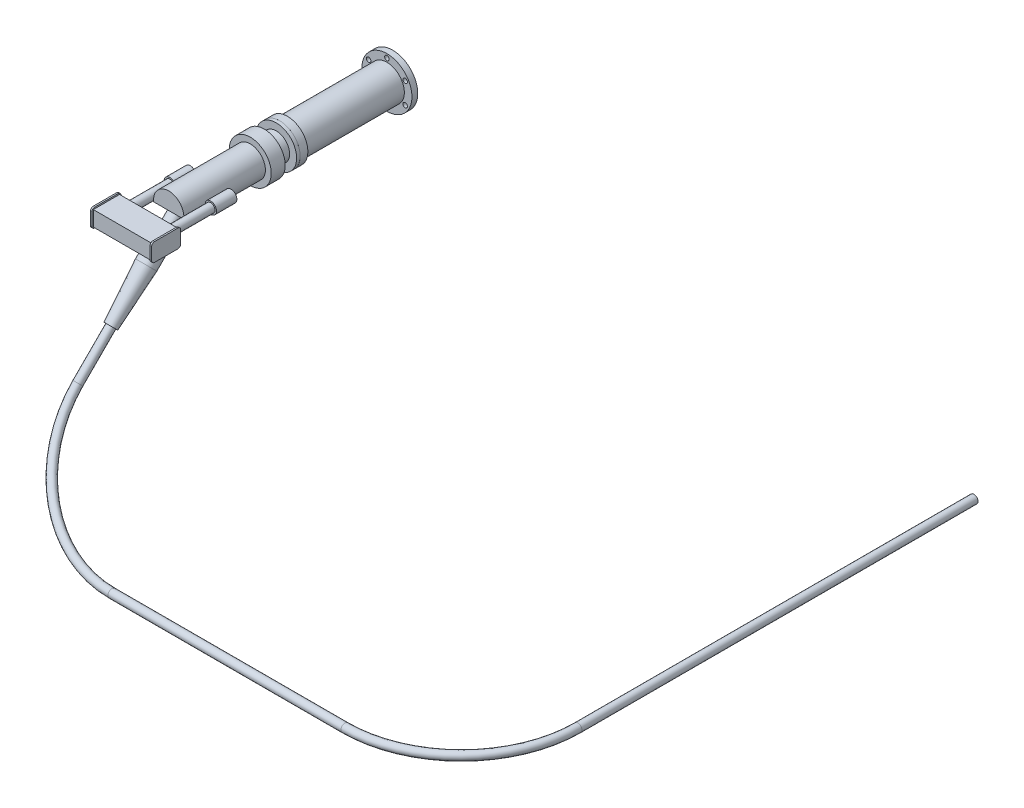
ISO-10303-21;
HEADER;
FILE_DESCRIPTION(('STEP AP214'),'2;1');
FILE_NAME('part.step','',(''),(''),'','','');
FILE_SCHEMA(('AUTOMOTIVE_DESIGN { 1 0 10303 214 1 1 1 1 }'));
ENDSEC;
DATA;
#1=APPLICATION_CONTEXT('core data for automotive mechanical design processes');
#2=APPLICATION_PROTOCOL_DEFINITION('international standard','automotive_design',2000,#1);
#3=PRODUCT_CONTEXT('',#1,'mechanical');
#4=PRODUCT('Part','Part','',(#3));
#5=PRODUCT_RELATED_PRODUCT_CATEGORY('part','',(#4));
#6=PRODUCT_DEFINITION_FORMATION('','',#4);
#7=PRODUCT_DEFINITION_CONTEXT('part definition',#1,'design');
#8=PRODUCT_DEFINITION('design','',#6,#7);
#9=PRODUCT_DEFINITION_SHAPE('','',#8);
#10=(LENGTH_UNIT() NAMED_UNIT(*) SI_UNIT(.MILLI.,.METRE.));
#11=(NAMED_UNIT(*) PLANE_ANGLE_UNIT() SI_UNIT($,.RADIAN.));
#12=(NAMED_UNIT(*) SI_UNIT($,.STERADIAN.) SOLID_ANGLE_UNIT());
#13=UNCERTAINTY_MEASURE_WITH_UNIT(LENGTH_MEASURE(1.E-05),#10,'distance_accuracy_value','');
#14=(GEOMETRIC_REPRESENTATION_CONTEXT(3) GLOBAL_UNCERTAINTY_ASSIGNED_CONTEXT((#13)) GLOBAL_UNIT_ASSIGNED_CONTEXT((#10,
#11,#12)) REPRESENTATION_CONTEXT('',''));
#15=CARTESIAN_POINT('',(0.,0.,0.));
#16=DIRECTION('',(0.,0.,1.));
#17=DIRECTION('',(1.,0.,0.));
#18=AXIS2_PLACEMENT_3D('',#15,#16,#17);
#19=CARTESIAN_POINT('',(0.,0.,-50.673));
#20=DIRECTION('',(0.,0.,-1.));
#21=DIRECTION('',(-1.,0.,0.));
#22=AXIS2_PLACEMENT_3D('',#19,#20,#21);
#23=PLANE('',#22);
#24=CARTESIAN_POINT('',(0.,0.,-50.673));
#25=DIRECTION('',(0.,0.,-1.));
#26=DIRECTION('',(-1.,0.,0.));
#27=AXIS2_PLACEMENT_3D('',#24,#25,#26);
#28=CIRCLE('',#27,44.45);
#29=CARTESIAN_POINT('',(-44.45,0.,-50.673));
#30=VERTEX_POINT('',#29);
#31=EDGE_CURVE('E11',#30,#30,#28,.T.);
#32=ORIENTED_EDGE('',*,*,#31,.T.);
#33=EDGE_LOOP('',(#32));
#34=FACE_BOUND('',#33,.T.);
#35=CARTESIAN_POINT('',(0.,0.,-50.673));
#36=DIRECTION('',(0.,0.,-1.));
#37=DIRECTION('',(-1.,0.,0.));
#38=AXIS2_PLACEMENT_3D('',#35,#36,#37);
#39=CIRCLE('',#38,38.1);
#40=CARTESIAN_POINT('',(-38.1,0.,-50.673));
#41=VERTEX_POINT('',#40);
#42=EDGE_CURVE('E397',#41,#41,#39,.T.);
#43=ORIENTED_EDGE('',*,*,#42,.F.);
#44=EDGE_LOOP('',(#43));
#45=FACE_BOUND('',#44,.T.);
#46=ADVANCED_FACE('F382',(#34,#45),#23,.T.);
#47=CARTESIAN_POINT('',(0.,0.,-50.673));
#48=DIRECTION('',(0.,0.,1.));
#49=DIRECTION('',(1.,0.,0.));
#50=AXIS2_PLACEMENT_3D('',#47,#48,#49);
#51=CYLINDRICAL_SURFACE('',#50,44.45);
#52=ORIENTED_EDGE('',*,*,#31,.F.);
#53=EDGE_LOOP('',(#52));
#54=FACE_BOUND('',#53,.T.);
#55=CARTESIAN_POINT('',(0.,0.,-33.782));
#56=DIRECTION('',(0.,0.,-1.));
#57=DIRECTION('',(-1.,0.,0.));
#58=AXIS2_PLACEMENT_3D('',#55,#56,#57);
#59=CIRCLE('',#58,44.45);
#60=CARTESIAN_POINT('',(-44.45,0.,-33.782));
#61=VERTEX_POINT('',#60);
#62=EDGE_CURVE('E389',#61,#61,#59,.T.);
#63=ORIENTED_EDGE('',*,*,#62,.T.);
#64=EDGE_LOOP('',(#63));
#65=FACE_BOUND('',#64,.T.);
#66=ADVANCED_FACE('F384',(#54,#65),#51,.T.);
#67=CARTESIAN_POINT('',(0.,0.,-33.782));
#68=DIRECTION('',(0.,0.,-1.));
#69=DIRECTION('',(-1.,0.,0.));
#70=AXIS2_PLACEMENT_3D('',#67,#68,#69);
#71=PLANE('',#70);
#72=ORIENTED_EDGE('',*,*,#62,.F.);
#73=EDGE_LOOP('',(#72));
#74=FACE_BOUND('',#73,.T.);
#75=ADVANCED_FACE('F481',(#74),#71,.F.);
#76=CARTESIAN_POINT('',(0.,0.,-267.462));
#77=DIRECTION('',(0.,0.,1.));
#78=DIRECTION('',(1.,0.,0.));
#79=AXIS2_PLACEMENT_3D('',#76,#77,#78);
#80=CYLINDRICAL_SURFACE('',#79,38.1);
#81=CARTESIAN_POINT('',(0.,0.,-267.462));
#82=DIRECTION('',(0.,0.,-1.));
#83=DIRECTION('',(-1.,0.,0.));
#84=AXIS2_PLACEMENT_3D('',#81,#82,#83);
#85=CIRCLE('',#84,38.1);
#86=CARTESIAN_POINT('',(-38.1,0.,-267.462));
#87=VERTEX_POINT('',#86);
#88=EDGE_CURVE('E393',#87,#87,#85,.T.);
#89=ORIENTED_EDGE('',*,*,#88,.F.);
#90=EDGE_LOOP('',(#89));
#91=FACE_BOUND('',#90,.T.);
#92=ORIENTED_EDGE('',*,*,#42,.T.);
#93=EDGE_LOOP('',(#92));
#94=FACE_BOUND('',#93,.T.);
#95=ADVANCED_FACE('F474',(#91,#94),#80,.T.);
#96=CARTESIAN_POINT('',(0.,0.,-267.462));
#97=DIRECTION('',(0.,0.,-1.));
#98=DIRECTION('',(-1.,0.,0.));
#99=AXIS2_PLACEMENT_3D('',#96,#97,#98);
#100=PLANE('',#99);
#101=CARTESIAN_POINT('',(39.8696445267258,23.0187500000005,-267.462));
#102=DIRECTION('',(0.,0.,-1.));
#103=DIRECTION('',(-1.,0.,0.));
#104=AXIS2_PLACEMENT_3D('',#101,#102,#103);
#105=CIRCLE('',#104,4.9657);
#106=CARTESIAN_POINT('',(34.9039445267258,23.0187500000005,-267.462));
#107=VERTEX_POINT('',#106);
#108=EDGE_CURVE('E438',#107,#107,#105,.F.);
#109=ORIENTED_EDGE('',*,*,#108,.F.);
#110=EDGE_LOOP('',(#109));
#111=FACE_BOUND('',#110,.T.);
#112=CARTESIAN_POINT('',(39.8696445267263,-23.0187499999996,-267.462));
#113=DIRECTION('',(0.,0.,-1.));
#114=DIRECTION('',(-1.,0.,0.));
#115=AXIS2_PLACEMENT_3D('',#112,#113,#114);
#116=CIRCLE('',#115,4.9657);
#117=CARTESIAN_POINT('',(34.9039445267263,-23.0187499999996,-267.462));
#118=VERTEX_POINT('',#117);
#119=EDGE_CURVE('E432',#118,#118,#116,.F.);
#120=ORIENTED_EDGE('',*,*,#119,.F.);
#121=EDGE_LOOP('',(#120));
#122=FACE_BOUND('',#121,.T.);
#123=CARTESIAN_POINT('',(3.21478330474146E-13,-46.0375,-267.462));
#124=DIRECTION('',(0.,0.,-1.));
#125=DIRECTION('',(-1.,0.,0.));
#126=AXIS2_PLACEMENT_3D('',#123,#124,#125);
#127=CIRCLE('',#126,4.9657);
#128=CARTESIAN_POINT('',(-4.96569999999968,-46.0375,-267.462));
#129=VERTEX_POINT('',#128);
#130=EDGE_CURVE('E426',#129,#129,#127,.F.);
#131=ORIENTED_EDGE('',*,*,#130,.F.);
#132=EDGE_LOOP('',(#131));
#133=FACE_BOUND('',#132,.T.);
#134=CARTESIAN_POINT('',(-39.869644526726,-23.0187500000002,-267.462));
#135=DIRECTION('',(0.,0.,-1.));
#136=DIRECTION('',(-1.,0.,0.));
#137=AXIS2_PLACEMENT_3D('',#134,#135,#136);
#138=CIRCLE('',#137,4.9657);
#139=CARTESIAN_POINT('',(-44.835344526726,-23.0187500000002,-267.462));
#140=VERTEX_POINT('',#139);
#141=EDGE_CURVE('E420',#140,#140,#138,.F.);
#142=ORIENTED_EDGE('',*,*,#141,.F.);
#143=EDGE_LOOP('',(#142));
#144=FACE_BOUND('',#143,.T.);
#145=CARTESIAN_POINT('',(-39.8696445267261,23.0187499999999,-267.462));
#146=DIRECTION('',(0.,0.,-1.));
#147=DIRECTION('',(-1.,0.,0.));
#148=AXIS2_PLACEMENT_3D('',#145,#146,#147);
#149=CIRCLE('',#148,4.9657);
#150=CARTESIAN_POINT('',(-44.8353445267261,23.0187499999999,-267.462));
#151=VERTEX_POINT('',#150);
#152=EDGE_CURVE('E414',#151,#151,#149,.F.);
#153=ORIENTED_EDGE('',*,*,#152,.F.);
#154=EDGE_LOOP('',(#153));
#155=FACE_BOUND('',#154,.T.);
#156=CARTESIAN_POINT('',(0.,46.0375,-267.462));
#157=DIRECTION('',(0.,0.,-1.));
#158=DIRECTION('',(-1.,0.,0.));
#159=AXIS2_PLACEMENT_3D('',#156,#157,#158);
#160=CIRCLE('',#159,4.9657);
#161=CARTESIAN_POINT('',(-4.9657,46.0375,-267.462));
#162=VERTEX_POINT('',#161);
#163=EDGE_CURVE('E408',#162,#162,#160,.F.);
#164=ORIENTED_EDGE('',*,*,#163,.F.);
#165=EDGE_LOOP('',(#164));
#166=FACE_BOUND('',#165,.T.);
#167=CARTESIAN_POINT('',(0.,0.,-267.462));
#168=DIRECTION('',(0.,0.,-1.));
#169=DIRECTION('',(-1.,0.,0.));
#170=AXIS2_PLACEMENT_3D('',#167,#168,#169);
#171=CIRCLE('',#170,54.61);
#172=CARTESIAN_POINT('',(-54.61,0.,-267.462));
#173=VERTEX_POINT('',#172);
#174=EDGE_CURVE('E405',#173,#173,#171,.T.);
#175=ORIENTED_EDGE('',*,*,#174,.F.);
#176=EDGE_LOOP('',(#175));
#177=FACE_BOUND('',#176,.T.);
#178=ORIENTED_EDGE('',*,*,#88,.T.);
#179=EDGE_LOOP('',(#178));
#180=FACE_BOUND('',#179,.T.);
#181=ADVANCED_FACE('F468',(#111,#122,#133,#144,#155,#166,#177,#180),#100,.F.);
#182=CARTESIAN_POINT('',(0.,0.,-280.162));
#183=DIRECTION('',(0.,0.,1.));
#184=DIRECTION('',(1.,0.,0.));
#185=AXIS2_PLACEMENT_3D('',#182,#183,#184);
#186=CYLINDRICAL_SURFACE('',#185,54.61);
#187=CARTESIAN_POINT('',(0.,0.,-280.162));
#188=DIRECTION('',(0.,0.,-1.));
#189=DIRECTION('',(-1.,0.,0.));
#190=AXIS2_PLACEMENT_3D('',#187,#188,#189);
#191=CIRCLE('',#190,54.61);
#192=CARTESIAN_POINT('',(-54.61,0.,-280.162));
#193=VERTEX_POINT('',#192);
#194=EDGE_CURVE('E402',#193,#193,#191,.T.);
#195=ORIENTED_EDGE('',*,*,#194,.F.);
#196=EDGE_LOOP('',(#195));
#197=FACE_BOUND('',#196,.T.);
#198=ORIENTED_EDGE('',*,*,#174,.T.);
#199=EDGE_LOOP('',(#198));
#200=FACE_BOUND('',#199,.T.);
#201=ADVANCED_FACE('F452',(#197,#200),#186,.T.);
#202=CARTESIAN_POINT('',(0.,0.,-280.162));
#203=DIRECTION('',(0.,0.,-1.));
#204=DIRECTION('',(-1.,0.,0.));
#205=AXIS2_PLACEMENT_3D('',#202,#203,#204);
#206=PLANE('',#205);
#207=CARTESIAN_POINT('',(39.8696445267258,23.0187500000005,-280.162));
#208=DIRECTION('',(0.,0.,-1.));
#209=DIRECTION('',(-0.50000000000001,0.866025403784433,0.));
#210=AXIS2_PLACEMENT_3D('',#207,#208,#209);
#211=CIRCLE('',#210,4.9657);
#212=CARTESIAN_POINT('',(37.3867945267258,27.3191723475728,-280.162));
#213=VERTEX_POINT('',#212);
#214=EDGE_CURVE('E441',#213,#213,#211,.T.);
#215=ORIENTED_EDGE('',*,*,#214,.F.);
#216=EDGE_LOOP('',(#215));
#217=FACE_BOUND('',#216,.T.);
#218=CARTESIAN_POINT('',(39.8696445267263,-23.0187499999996,-280.162));
#219=DIRECTION('',(0.,0.,-1.));
#220=DIRECTION('',(0.499999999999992,0.866025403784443,0.));
#221=AXIS2_PLACEMENT_3D('',#218,#219,#220);
#222=CIRCLE('',#221,4.9657);
#223=CARTESIAN_POINT('',(42.3524945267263,-18.7183276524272,-280.162));
#224=VERTEX_POINT('',#223);
#225=EDGE_CURVE('E435',#224,#224,#222,.T.);
#226=ORIENTED_EDGE('',*,*,#225,.F.);
#227=EDGE_LOOP('',(#226));
#228=FACE_BOUND('',#227,.T.);
#229=CARTESIAN_POINT('',(3.21478330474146E-13,-46.0375,-280.162));
#230=DIRECTION('',(0.,0.,-1.));
#231=DIRECTION('',(1.,0.,0.));
#232=AXIS2_PLACEMENT_3D('',#229,#230,#231);
#233=CIRCLE('',#232,4.9657);
#234=CARTESIAN_POINT('',(4.96570000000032,-46.0375,-280.162));
#235=VERTEX_POINT('',#234);
#236=EDGE_CURVE('E429',#235,#235,#233,.T.);
#237=ORIENTED_EDGE('',*,*,#236,.F.);
#238=EDGE_LOOP('',(#237));
#239=FACE_BOUND('',#238,.T.);
#240=CARTESIAN_POINT('',(-39.869644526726,-23.0187500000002,-280.162));
#241=DIRECTION('',(0.,0.,-1.));
#242=DIRECTION('',(0.500000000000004,-0.866025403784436,0.));
#243=AXIS2_PLACEMENT_3D('',#240,#241,#242);
#244=CIRCLE('',#243,4.9657);
#245=CARTESIAN_POINT('',(-37.386794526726,-27.3191723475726,-280.162));
#246=VERTEX_POINT('',#245);
#247=EDGE_CURVE('E423',#246,#246,#244,.T.);
#248=ORIENTED_EDGE('',*,*,#247,.F.);
#249=EDGE_LOOP('',(#248));
#250=FACE_BOUND('',#249,.T.);
#251=CARTESIAN_POINT('',(-39.8696445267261,23.0187499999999,-280.162));
#252=DIRECTION('',(0.,0.,-1.));
#253=DIRECTION('',(-0.499999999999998,-0.86602540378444,0.));
#254=AXIS2_PLACEMENT_3D('',#251,#252,#253);
#255=CIRCLE('',#254,4.9657);
#256=CARTESIAN_POINT('',(-42.3524945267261,18.7183276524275,-280.162));
#257=VERTEX_POINT('',#256);
#258=EDGE_CURVE('E417',#257,#257,#255,.T.);
#259=ORIENTED_EDGE('',*,*,#258,.F.);
#260=EDGE_LOOP('',(#259));
#261=FACE_BOUND('',#260,.T.);
#262=CARTESIAN_POINT('',(0.,46.0375,-280.162));
#263=DIRECTION('',(0.,0.,-1.));
#264=DIRECTION('',(-1.,0.,0.));
#265=AXIS2_PLACEMENT_3D('',#262,#263,#264);
#266=CIRCLE('',#265,4.9657);
#267=CARTESIAN_POINT('',(-4.9657,46.0375,-280.162));
#268=VERTEX_POINT('',#267);
#269=EDGE_CURVE('E411',#268,#268,#266,.T.);
#270=ORIENTED_EDGE('',*,*,#269,.F.);
#271=EDGE_LOOP('',(#270));
#272=FACE_BOUND('',#271,.T.);
#273=ORIENTED_EDGE('',*,*,#194,.T.);
#274=EDGE_LOOP('',(#273));
#275=FACE_BOUND('',#274,.T.);
#276=ADVANCED_FACE('F448',(#217,#228,#239,#250,#261,#272,#275),#206,.T.);
#277=CARTESIAN_POINT('',(0.,46.0375,594.884214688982));
#278=DIRECTION('',(0.,0.,-1.));
#279=DIRECTION('',(-1.,0.,0.));
#280=AXIS2_PLACEMENT_3D('',#277,#278,#279);
#281=CYLINDRICAL_SURFACE('',#280,4.9657);
#282=ORIENTED_EDGE('',*,*,#269,.T.);
#283=EDGE_LOOP('',(#282));
#284=FACE_BOUND('',#283,.T.);
#285=ORIENTED_EDGE('',*,*,#163,.T.);
#286=EDGE_LOOP('',(#285));
#287=FACE_BOUND('',#286,.T.);
#288=ADVANCED_FACE('F451',(#284,#287),#281,.F.);
#289=CARTESIAN_POINT('',(-39.8696445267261,23.0187499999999,-33.781));
#290=DIRECTION('',(0.,0.,-1.));
#291=DIRECTION('',(-1.,0.,0.));
#292=AXIS2_PLACEMENT_3D('',#289,#290,#291);
#293=CYLINDRICAL_SURFACE('',#292,4.9657);
#294=ORIENTED_EDGE('',*,*,#258,.T.);
#295=EDGE_LOOP('',(#294));
#296=FACE_BOUND('',#295,.T.);
#297=ORIENTED_EDGE('',*,*,#152,.T.);
#298=EDGE_LOOP('',(#297));
#299=FACE_BOUND('',#298,.T.);
#300=ADVANCED_FACE('F496',(#296,#299),#293,.F.);
#301=CARTESIAN_POINT('',(-39.869644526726,-23.0187500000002,-33.781));
#302=DIRECTION('',(0.,0.,-1.));
#303=DIRECTION('',(-1.,0.,0.));
#304=AXIS2_PLACEMENT_3D('',#301,#302,#303);
#305=CYLINDRICAL_SURFACE('',#304,4.9657);
#306=ORIENTED_EDGE('',*,*,#247,.T.);
#307=EDGE_LOOP('',(#306));
#308=FACE_BOUND('',#307,.T.);
#309=ORIENTED_EDGE('',*,*,#141,.T.);
#310=EDGE_LOOP('',(#309));
#311=FACE_BOUND('',#310,.T.);
#312=ADVANCED_FACE('F500',(#308,#311),#305,.F.);
#313=CARTESIAN_POINT('',(3.21478330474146E-13,-46.0375,-33.781));
#314=DIRECTION('',(0.,0.,-1.));
#315=DIRECTION('',(-1.,0.,0.));
#316=AXIS2_PLACEMENT_3D('',#313,#314,#315);
#317=CYLINDRICAL_SURFACE('',#316,4.9657);
#318=ORIENTED_EDGE('',*,*,#236,.T.);
#319=EDGE_LOOP('',(#318));
#320=FACE_BOUND('',#319,.T.);
#321=ORIENTED_EDGE('',*,*,#130,.T.);
#322=EDGE_LOOP('',(#321));
#323=FACE_BOUND('',#322,.T.);
#324=ADVANCED_FACE('F504',(#320,#323),#317,.F.);
#325=CARTESIAN_POINT('',(39.8696445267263,-23.0187499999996,-33.781));
#326=DIRECTION('',(0.,0.,-1.));
#327=DIRECTION('',(-1.,0.,0.));
#328=AXIS2_PLACEMENT_3D('',#325,#326,#327);
#329=CYLINDRICAL_SURFACE('',#328,4.9657);
#330=ORIENTED_EDGE('',*,*,#225,.T.);
#331=EDGE_LOOP('',(#330));
#332=FACE_BOUND('',#331,.T.);
#333=ORIENTED_EDGE('',*,*,#119,.T.);
#334=EDGE_LOOP('',(#333));
#335=FACE_BOUND('',#334,.T.);
#336=ADVANCED_FACE('F508',(#332,#335),#329,.F.);
#337=CARTESIAN_POINT('',(39.8696445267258,23.0187500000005,-33.781));
#338=DIRECTION('',(0.,0.,-1.));
#339=DIRECTION('',(-1.,0.,0.));
#340=AXIS2_PLACEMENT_3D('',#337,#338,#339);
#341=CYLINDRICAL_SURFACE('',#340,4.9657);
#342=ORIENTED_EDGE('',*,*,#214,.T.);
#343=EDGE_LOOP('',(#342));
#344=FACE_BOUND('',#343,.T.);
#345=ORIENTED_EDGE('',*,*,#108,.T.);
#346=EDGE_LOOP('',(#345));
#347=FACE_BOUND('',#346,.T.);
#348=ADVANCED_FACE('F445',(#344,#347),#341,.F.);
#349=CLOSED_SHELL('',(#46,#66,#75,#95,#181,#201,#276,#288,#300,#312,#324,#336,#348));
#350=MANIFOLD_SOLID_BREP('B2',#349);
#351=CARTESIAN_POINT('',(1016.,-410.733214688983,331.993214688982));
#352=DIRECTION('',(0.,0.,-1.));
#353=DIRECTION('',(0.,1.,0.));
#354=AXIS2_PLACEMENT_3D('',#351,#352,#353);
#355=CYLINDRICAL_SURFACE('',#354,8.89);
#356=CARTESIAN_POINT('',(1016.,-410.733214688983,331.993214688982));
#357=DIRECTION('',(0.,0.,-1.));
#358=DIRECTION('',(-0.707106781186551,-0.707106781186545,0.));
#359=AXIS2_PLACEMENT_3D('',#356,#357,#358);
#360=CIRCLE('',#359,8.89);
#361=CARTESIAN_POINT('',(1024.89,-410.733214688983,331.993214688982));
#362=VERTEX_POINT('',#361);
#363=EDGE_CURVE('E599',#362,#362,#360,.T.);
#364=ORIENTED_EDGE('',*,*,#363,.T.);
#365=EDGE_LOOP('',(#364));
#366=FACE_BOUND('',#365,.T.);
#367=CARTESIAN_POINT('',(1016.,-410.733214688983,-531.606785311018));
#368=DIRECTION('',(0.,0.,-1.));
#369=DIRECTION('',(-0.707106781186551,-0.707106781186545,0.));
#370=AXIS2_PLACEMENT_3D('',#367,#368,#369);
#371=CIRCLE('',#370,8.89);
#372=CARTESIAN_POINT('',(1009.71382071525,-417.019393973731,-531.606785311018));
#373=VERTEX_POINT('',#372);
#374=EDGE_CURVE('E381',#373,#373,#371,.T.);
#375=ORIENTED_EDGE('',*,*,#374,.F.);
#376=EDGE_LOOP('',(#375));
#377=FACE_BOUND('',#376,.T.);
#378=ADVANCED_FACE('F593',(#366,#377),#355,.T.);
#379=CARTESIAN_POINT('',(762.,-410.733214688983,331.993214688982));
#380=DIRECTION('',(0.,1.,0.));
#381=DIRECTION('',(0.,0.,1.));
#382=AXIS2_PLACEMENT_3D('',#379,#380,#381);
#383=TOROIDAL_SURFACE('',#382,254.,8.89);
#384=CARTESIAN_POINT('',(762.,-410.733214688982,585.993214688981));
#385=DIRECTION('',(1.,0.,0.));
#386=DIRECTION('',(0.,-0.707106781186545,-0.70710678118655));
#387=AXIS2_PLACEMENT_3D('',#384,#385,#386);
#388=CIRCLE('',#387,8.89);
#389=CARTESIAN_POINT('',(762.,-410.733214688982,594.883214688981));
#390=VERTEX_POINT('',#389);
#391=EDGE_CURVE('E603',#390,#390,#388,.T.);
#392=CARTESIAN_POINT('',(762.,-410.733214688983,331.993214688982));
#393=DIRECTION('',(0.,1.,0.));
#394=DIRECTION('',(0.,0.,1.));
#395=AXIS2_PLACEMENT_3D('',#392,#393,#394);
#396=CIRCLE('',#395,262.89);
#397=EDGE_CURVE('',#390,#362,#396,.T.);
#398=ORIENTED_EDGE('',*,*,#391,.T.);
#399=ORIENTED_EDGE('',*,*,#363,.F.);
#400=ORIENTED_EDGE('',*,*,#397,.T.);
#401=ORIENTED_EDGE('',*,*,#397,.F.);
#402=EDGE_LOOP('',(#398,#400,#399,#401));
#403=FACE_BOUND('',#402,.T.);
#404=ADVANCED_FACE('F630',(#403),#383,.T.);
#405=CARTESIAN_POINT('',(254.,-410.733214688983,585.993214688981));
#406=DIRECTION('',(1.,0.,0.));
#407=DIRECTION('',(0.,0.,-1.));
#408=AXIS2_PLACEMENT_3D('',#405,#406,#407);
#409=CYLINDRICAL_SURFACE('',#408,8.89);
#410=CARTESIAN_POINT('',(254.,-410.733214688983,585.993214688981));
#411=DIRECTION('',(1.,0.,0.));
#412=DIRECTION('',(0.,-0.707106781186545,-0.70710678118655));
#413=AXIS2_PLACEMENT_3D('',#410,#411,#412);
#414=CIRCLE('',#413,8.89);
#415=CARTESIAN_POINT('',(254.,-417.019393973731,592.279393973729));
#416=VERTEX_POINT('',#415);
#417=EDGE_CURVE('E607',#416,#416,#414,.T.);
#418=ORIENTED_EDGE('',*,*,#417,.T.);
#419=EDGE_LOOP('',(#418));
#420=FACE_BOUND('',#419,.T.);
#421=ORIENTED_EDGE('',*,*,#391,.F.);
#422=EDGE_LOOP('',(#421));
#423=FACE_BOUND('',#422,.T.);
#424=ADVANCED_FACE('F634',(#420,#423),#409,.T.);
#425=CARTESIAN_POINT('',(254.,-231.128092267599,406.388092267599));
#426=DIRECTION('',(0.,0.707106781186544,0.707106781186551));
#427=DIRECTION('',(0.,-0.707106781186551,0.707106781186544));
#428=AXIS2_PLACEMENT_3D('',#425,#426,#427);
#429=TOROIDAL_SURFACE('',#428,254.,8.89);
#430=CARTESIAN_POINT('',(0.,-231.128092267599,406.388092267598));
#431=DIRECTION('',(0.,-0.707106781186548,0.707106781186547));
#432=DIRECTION('',(0.,-0.707106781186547,-0.707106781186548));
#433=AXIS2_PLACEMENT_3D('',#430,#431,#432);
#434=CIRCLE('',#433,8.89);
#435=CARTESIAN_POINT('',(-8.89000000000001,-231.128092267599,406.388092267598));
#436=VERTEX_POINT('',#435);
#437=EDGE_CURVE('E612',#436,#436,#434,.T.);
#438=CARTESIAN_POINT('',(254.,-231.128092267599,406.388092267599));
#439=DIRECTION('',(0.,0.707106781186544,0.707106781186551));
#440=DIRECTION('',(0.,-0.707106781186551,0.707106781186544));
#441=AXIS2_PLACEMENT_3D('',#438,#439,#440);
#442=CIRCLE('',#441,262.89);
#443=EDGE_CURVE('',#436,#416,#442,.T.);
#444=ORIENTED_EDGE('',*,*,#437,.T.);
#445=ORIENTED_EDGE('',*,*,#417,.F.);
#446=ORIENTED_EDGE('',*,*,#443,.T.);
#447=ORIENTED_EDGE('',*,*,#443,.F.);
#448=EDGE_LOOP('',(#444,#446,#445,#447));
#449=FACE_BOUND('',#448,.T.);
#450=ADVANCED_FACE('F640',(#449),#429,.T.);
#451=CARTESIAN_POINT('',(0.,-231.128092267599,406.388092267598));
#452=DIRECTION('',(0.,0.707106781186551,-0.707106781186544));
#453=DIRECTION('',(0.,0.707106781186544,0.707106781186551));
#454=AXIS2_PLACEMENT_3D('',#451,#452,#453);
#455=CYLINDRICAL_SURFACE('',#454,8.89);
#456=ORIENTED_EDGE('',*,*,#437,.F.);
#457=EDGE_LOOP('',(#456));
#458=FACE_BOUND('',#457,.T.);
#459=CARTESIAN_POINT('',(0.,-159.286043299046,334.546043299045));
#460=DIRECTION('',(0.,-0.707106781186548,0.707106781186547));
#461=DIRECTION('',(0.,-0.707106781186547,-0.707106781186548));
#462=AXIS2_PLACEMENT_3D('',#459,#460,#461);
#463=CIRCLE('',#462,8.89);
#464=CARTESIAN_POINT('',(0.,-165.572222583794,328.259864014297));
#465=VERTEX_POINT('',#464);
#466=EDGE_CURVE('E615',#465,#465,#463,.T.);
#467=ORIENTED_EDGE('',*,*,#466,.T.);
#468=EDGE_LOOP('',(#467));
#469=FACE_BOUND('',#468,.T.);
#470=ADVANCED_FACE('F619',(#458,#469),#455,.T.);
#471=CARTESIAN_POINT('',(1016.,-410.733214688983,-531.606785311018));
#472=DIRECTION('',(0.,0.,-1.));
#473=DIRECTION('',(-0.707106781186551,-0.707106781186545,0.));
#474=AXIS2_PLACEMENT_3D('',#471,#472,#473);
#475=PLANE('',#474);
#476=ORIENTED_EDGE('',*,*,#374,.T.);
#477=EDGE_LOOP('',(#476));
#478=FACE_BOUND('',#477,.T.);
#479=ADVANCED_FACE('F623',(#478),#475,.T.);
#480=CARTESIAN_POINT('',(0.,-159.286043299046,334.546043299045));
#481=DIRECTION('',(0.,-0.707106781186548,0.707106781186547));
#482=DIRECTION('',(0.,-0.707106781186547,-0.707106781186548));
#483=AXIS2_PLACEMENT_3D('',#480,#481,#482);
#484=PLANE('',#483);
#485=ORIENTED_EDGE('',*,*,#466,.F.);
#486=EDGE_LOOP('',(#485));
#487=FACE_BOUND('',#486,.T.);
#488=ADVANCED_FACE('F621',(#487),#484,.F.);
#489=CLOSED_SHELL('',(#378,#404,#424,#450,#470,#479,#488));
#490=MANIFOLD_SOLID_BREP('B6',#489);
#491=CARTESIAN_POINT('',(-66.802,13.335,306.07));
#492=DIRECTION('',(1.,0.,0.));
#493=DIRECTION('',(0.,0.,1.));
#494=AXIS2_PLACEMENT_3D('',#491,#492,#493);
#495=CYLINDRICAL_SURFACE('',#494,6.34999999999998);
#496=CARTESIAN_POINT('',(-63.5,13.335,306.07));
#497=DIRECTION('',(1.,0.,0.));
#498=DIRECTION('',(0.,0.,1.));
#499=AXIS2_PLACEMENT_3D('',#496,#497,#498);
#500=CIRCLE('',#499,6.34999999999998);
#501=CARTESIAN_POINT('',(-63.5,19.685,306.07));
#502=VERTEX_POINT('',#501);
#503=CARTESIAN_POINT('',(-63.5,13.335,312.42));
#504=VERTEX_POINT('',#503);
#505=EDGE_CURVE('E760',#502,#504,#500,.T.);
#506=ORIENTED_EDGE('',*,*,#505,.F.);
#507=DIRECTION('',(1.,0.,0.));
#508=VECTOR('',#507,1.);
#509=CARTESIAN_POINT('',(-66.802,19.685,306.07));
#510=LINE('',#509,#508);
#511=CARTESIAN_POINT('',(-66.802,19.685,306.07));
#512=VERTEX_POINT('',#511);
#513=EDGE_CURVE('E803',#512,#502,#510,.T.);
#514=ORIENTED_EDGE('',*,*,#513,.F.);
#515=CARTESIAN_POINT('',(-66.802,13.335,306.07));
#516=DIRECTION('',(1.,0.,0.));
#517=DIRECTION('',(0.,0.,1.));
#518=AXIS2_PLACEMENT_3D('',#515,#516,#517);
#519=CIRCLE('',#518,6.34999999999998);
#520=CARTESIAN_POINT('',(-66.802,13.335,312.42));
#521=VERTEX_POINT('',#520);
#522=EDGE_CURVE('E765',#512,#521,#519,.T.);
#523=ORIENTED_EDGE('',*,*,#522,.T.);
#524=DIRECTION('',(1.,0.,0.));
#525=VECTOR('',#524,1.);
#526=CARTESIAN_POINT('',(-66.802,13.335,312.42));
#527=LINE('',#526,#525);
#528=EDGE_CURVE('E591',#521,#504,#527,.T.);
#529=ORIENTED_EDGE('',*,*,#528,.T.);
#530=EDGE_LOOP('',(#506,#514,#523,#529));
#531=FACE_BOUND('',#530,.T.);
#532=ADVANCED_FACE('F688',(#531),#495,.T.);
#533=CARTESIAN_POINT('',(-66.802,13.335,312.42));
#534=DIRECTION('',(0.,0.,-1.));
#535=DIRECTION('',(1.,0.,0.));
#536=AXIS2_PLACEMENT_3D('',#533,#534,#535);
#537=PLANE('',#536);
#538=DIRECTION('',(0.,-1.,0.));
#539=VECTOR('',#538,1.);
#540=CARTESIAN_POINT('',(-63.5,13.335,312.42));
#541=LINE('',#540,#539);
#542=CARTESIAN_POINT('',(-63.5,-13.335,312.42));
#543=VERTEX_POINT('',#542);
#544=EDGE_CURVE('E751',#504,#543,#541,.T.);
#545=ORIENTED_EDGE('',*,*,#544,.F.);
#546=ORIENTED_EDGE('',*,*,#528,.F.);
#547=DIRECTION('',(0.,-1.,0.));
#548=VECTOR('',#547,1.);
#549=CARTESIAN_POINT('',(-66.802,13.335,312.42));
#550=LINE('',#549,#548);
#551=CARTESIAN_POINT('',(-66.802,-13.335,312.42));
#552=VERTEX_POINT('',#551);
#553=EDGE_CURVE('E785',#521,#552,#550,.T.);
#554=ORIENTED_EDGE('',*,*,#553,.T.);
#555=DIRECTION('',(1.,0.,0.));
#556=VECTOR('',#555,1.);
#557=CARTESIAN_POINT('',(-66.802,-13.335,312.42));
#558=LINE('',#557,#556);
#559=EDGE_CURVE('E695',#552,#543,#558,.T.);
#560=ORIENTED_EDGE('',*,*,#559,.T.);
#561=EDGE_LOOP('',(#545,#546,#554,#560));
#562=FACE_BOUND('',#561,.T.);
#563=ADVANCED_FACE('F752',(#562),#537,.F.);
#564=CARTESIAN_POINT('',(-66.802,-13.335,306.07));
#565=DIRECTION('',(1.,0.,0.));
#566=DIRECTION('',(0.,0.,1.));
#567=AXIS2_PLACEMENT_3D('',#564,#565,#566);
#568=CYLINDRICAL_SURFACE('',#567,6.34999999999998);
#569=CARTESIAN_POINT('',(-63.5,-13.335,306.07));
#570=DIRECTION('',(1.,0.,0.));
#571=DIRECTION('',(0.,0.,-1.));
#572=AXIS2_PLACEMENT_3D('',#569,#570,#571);
#573=CIRCLE('',#572,6.34999999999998);
#574=CARTESIAN_POINT('',(-63.5,-19.685,306.07));
#575=VERTEX_POINT('',#574);
#576=EDGE_CURVE('E759',#543,#575,#573,.T.);
#577=ORIENTED_EDGE('',*,*,#576,.F.);
#578=ORIENTED_EDGE('',*,*,#559,.F.);
#579=CARTESIAN_POINT('',(-66.802,-13.335,306.07));
#580=DIRECTION('',(1.,0.,0.));
#581=DIRECTION('',(0.,0.,-1.));
#582=AXIS2_PLACEMENT_3D('',#579,#580,#581);
#583=CIRCLE('',#582,6.34999999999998);
#584=CARTESIAN_POINT('',(-66.802,-19.685,306.07));
#585=VERTEX_POINT('',#584);
#586=EDGE_CURVE('E787',#552,#585,#583,.T.);
#587=ORIENTED_EDGE('',*,*,#586,.T.);
#588=DIRECTION('',(1.,0.,0.));
#589=VECTOR('',#588,1.);
#590=CARTESIAN_POINT('',(-66.802,-19.685,306.07));
#591=LINE('',#590,#589);
#592=EDGE_CURVE('E817',#585,#575,#591,.T.);
#593=ORIENTED_EDGE('',*,*,#592,.T.);
#594=EDGE_LOOP('',(#577,#578,#587,#593));
#595=FACE_BOUND('',#594,.T.);
#596=ADVANCED_FACE('F821',(#595),#568,.T.);
#597=CARTESIAN_POINT('',(-66.802,-19.685,306.07));
#598=DIRECTION('',(0.,1.,0.));
#599=DIRECTION('',(0.,0.,1.));
#600=AXIS2_PLACEMENT_3D('',#597,#598,#599);
#601=PLANE('',#600);
#602=DIRECTION('',(0.,0.,-1.));
#603=VECTOR('',#602,1.);
#604=CARTESIAN_POINT('',(-63.5,-19.685,306.07));
#605=LINE('',#604,#603);
#606=CARTESIAN_POINT('',(-63.5,-19.685,255.27));
#607=VERTEX_POINT('',#606);
#608=EDGE_CURVE('E772',#575,#607,#605,.T.);
#609=ORIENTED_EDGE('',*,*,#608,.F.);
#610=ORIENTED_EDGE('',*,*,#592,.F.);
#611=DIRECTION('',(0.,0.,-1.));
#612=VECTOR('',#611,1.);
#613=CARTESIAN_POINT('',(-66.802,-19.685,306.07));
#614=LINE('',#613,#612);
#615=CARTESIAN_POINT('',(-66.802,-19.685,255.27));
#616=VERTEX_POINT('',#615);
#617=EDGE_CURVE('E790',#585,#616,#614,.T.);
#618=ORIENTED_EDGE('',*,*,#617,.T.);
#619=DIRECTION('',(1.,0.,0.));
#620=VECTOR('',#619,1.);
#621=CARTESIAN_POINT('',(-66.802,-19.685,255.27));
#622=LINE('',#621,#620);
#623=EDGE_CURVE('E814',#616,#607,#622,.T.);
#624=ORIENTED_EDGE('',*,*,#623,.T.);
#625=EDGE_LOOP('',(#609,#610,#618,#624));
#626=FACE_BOUND('',#625,.T.);
#627=ADVANCED_FACE('F823',(#626),#601,.F.);
#628=CARTESIAN_POINT('',(-66.802,-13.335,255.27));
#629=DIRECTION('',(1.,0.,0.));
#630=DIRECTION('',(0.,0.,1.));
#631=AXIS2_PLACEMENT_3D('',#628,#629,#630);
#632=CYLINDRICAL_SURFACE('',#631,6.35000000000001);
#633=CARTESIAN_POINT('',(-63.5,-13.335,255.27));
#634=DIRECTION('',(1.,0.,0.));
#635=DIRECTION('',(0.,0.,1.));
#636=AXIS2_PLACEMENT_3D('',#633,#634,#635);
#637=CIRCLE('',#636,6.35000000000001);
#638=CARTESIAN_POINT('',(-63.5,-13.335,248.92));
#639=VERTEX_POINT('',#638);
#640=EDGE_CURVE('E775',#607,#639,#637,.T.);
#641=ORIENTED_EDGE('',*,*,#640,.F.);
#642=ORIENTED_EDGE('',*,*,#623,.F.);
#643=CARTESIAN_POINT('',(-66.802,-13.335,255.27));
#644=DIRECTION('',(1.,0.,0.));
#645=DIRECTION('',(0.,0.,1.));
#646=AXIS2_PLACEMENT_3D('',#643,#644,#645);
#647=CIRCLE('',#646,6.35000000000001);
#648=CARTESIAN_POINT('',(-66.802,-13.335,248.92));
#649=VERTEX_POINT('',#648);
#650=EDGE_CURVE('E793',#616,#649,#647,.T.);
#651=ORIENTED_EDGE('',*,*,#650,.T.);
#652=DIRECTION('',(1.,0.,0.));
#653=VECTOR('',#652,1.);
#654=CARTESIAN_POINT('',(-66.802,-13.335,248.92));
#655=LINE('',#654,#653);
#656=EDGE_CURVE('E811',#649,#639,#655,.T.);
#657=ORIENTED_EDGE('',*,*,#656,.T.);
#658=EDGE_LOOP('',(#641,#642,#651,#657));
#659=FACE_BOUND('',#658,.T.);
#660=ADVANCED_FACE('F826',(#659),#632,.T.);
#661=CARTESIAN_POINT('',(-66.802,-13.335,248.92));
#662=DIRECTION('',(0.,0.,1.));
#663=DIRECTION('',(-1.,0.,0.));
#664=AXIS2_PLACEMENT_3D('',#661,#662,#663);
#665=PLANE('',#664);
#666=DIRECTION('',(0.,1.,0.));
#667=VECTOR('',#666,1.);
#668=CARTESIAN_POINT('',(-63.5,-13.335,248.92));
#669=LINE('',#668,#667);
#670=CARTESIAN_POINT('',(-63.5,13.335,248.92));
#671=VERTEX_POINT('',#670);
#672=EDGE_CURVE('E778',#639,#671,#669,.T.);
#673=ORIENTED_EDGE('',*,*,#672,.F.);
#674=ORIENTED_EDGE('',*,*,#656,.F.);
#675=DIRECTION('',(0.,1.,0.));
#676=VECTOR('',#675,1.);
#677=CARTESIAN_POINT('',(-66.802,-13.335,248.92));
#678=LINE('',#677,#676);
#679=CARTESIAN_POINT('',(-66.802,13.335,248.92));
#680=VERTEX_POINT('',#679);
#681=EDGE_CURVE('E796',#649,#680,#678,.T.);
#682=ORIENTED_EDGE('',*,*,#681,.T.);
#683=DIRECTION('',(1.,0.,0.));
#684=VECTOR('',#683,1.);
#685=CARTESIAN_POINT('',(-66.802,13.335,248.92));
#686=LINE('',#685,#684);
#687=EDGE_CURVE('E808',#680,#671,#686,.T.);
#688=ORIENTED_EDGE('',*,*,#687,.T.);
#689=EDGE_LOOP('',(#673,#674,#682,#688));
#690=FACE_BOUND('',#689,.T.);
#691=ADVANCED_FACE('F829',(#690),#665,.F.);
#692=CARTESIAN_POINT('',(-66.802,13.335,255.27));
#693=DIRECTION('',(1.,0.,0.));
#694=DIRECTION('',(0.,0.,1.));
#695=AXIS2_PLACEMENT_3D('',#692,#693,#694);
#696=CYLINDRICAL_SURFACE('',#695,6.35000000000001);
#697=CARTESIAN_POINT('',(-63.5,13.335,255.27));
#698=DIRECTION('',(1.,0.,0.));
#699=DIRECTION('',(0.,0.,1.));
#700=AXIS2_PLACEMENT_3D('',#697,#698,#699);
#701=CIRCLE('',#700,6.35000000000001);
#702=CARTESIAN_POINT('',(-63.5,19.685,255.27));
#703=VERTEX_POINT('',#702);
#704=EDGE_CURVE('E781',#671,#703,#701,.T.);
#705=ORIENTED_EDGE('',*,*,#704,.F.);
#706=ORIENTED_EDGE('',*,*,#687,.F.);
#707=CARTESIAN_POINT('',(-66.802,13.335,255.27));
#708=DIRECTION('',(1.,0.,0.));
#709=DIRECTION('',(0.,0.,1.));
#710=AXIS2_PLACEMENT_3D('',#707,#708,#709);
#711=CIRCLE('',#710,6.35000000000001);
#712=CARTESIAN_POINT('',(-66.802,19.685,255.27));
#713=VERTEX_POINT('',#712);
#714=EDGE_CURVE('E799',#680,#713,#711,.T.);
#715=ORIENTED_EDGE('',*,*,#714,.T.);
#716=DIRECTION('',(1.,0.,0.));
#717=VECTOR('',#716,1.);
#718=CARTESIAN_POINT('',(-66.802,19.685,255.27));
#719=LINE('',#718,#717);
#720=EDGE_CURVE('E805',#713,#703,#719,.T.);
#721=ORIENTED_EDGE('',*,*,#720,.T.);
#722=EDGE_LOOP('',(#705,#706,#715,#721));
#723=FACE_BOUND('',#722,.T.);
#724=ADVANCED_FACE('F832',(#723),#696,.T.);
#725=CARTESIAN_POINT('',(-66.802,19.685,255.27));
#726=DIRECTION('',(0.,-1.,0.));
#727=DIRECTION('',(0.,0.,-1.));
#728=AXIS2_PLACEMENT_3D('',#725,#726,#727);
#729=PLANE('',#728);
#730=DIRECTION('',(0.,0.,1.));
#731=VECTOR('',#730,1.);
#732=CARTESIAN_POINT('',(-63.5,19.685,255.27));
#733=LINE('',#732,#731);
#734=EDGE_CURVE('E768',#703,#502,#733,.T.);
#735=ORIENTED_EDGE('',*,*,#734,.F.);
#736=ORIENTED_EDGE('',*,*,#720,.F.);
#737=DIRECTION('',(0.,0.,1.));
#738=VECTOR('',#737,1.);
#739=CARTESIAN_POINT('',(-66.802,19.685,255.27));
#740=LINE('',#739,#738);
#741=EDGE_CURVE('E702',#713,#512,#740,.T.);
#742=ORIENTED_EDGE('',*,*,#741,.T.);
#743=ORIENTED_EDGE('',*,*,#513,.T.);
#744=EDGE_LOOP('',(#735,#736,#742,#743));
#745=FACE_BOUND('',#744,.T.);
#746=ADVANCED_FACE('F833',(#745),#729,.F.);
#747=CARTESIAN_POINT('',(-66.802,13.335,306.07));
#748=DIRECTION('',(1.,0.,0.));
#749=DIRECTION('',(0.,0.,1.));
#750=AXIS2_PLACEMENT_3D('',#747,#748,#749);
#751=PLANE('',#750);
#752=ORIENTED_EDGE('',*,*,#522,.F.);
#753=ORIENTED_EDGE('',*,*,#741,.F.);
#754=ORIENTED_EDGE('',*,*,#714,.F.);
#755=ORIENTED_EDGE('',*,*,#681,.F.);
#756=ORIENTED_EDGE('',*,*,#650,.F.);
#757=ORIENTED_EDGE('',*,*,#617,.F.);
#758=ORIENTED_EDGE('',*,*,#586,.F.);
#759=ORIENTED_EDGE('',*,*,#553,.F.);
#760=EDGE_LOOP('',(#752,#753,#754,#755,#756,#757,#758,#759));
#761=FACE_BOUND('',#760,.T.);
#762=ADVANCED_FACE('F835',(#761),#751,.F.);
#763=CARTESIAN_POINT('',(-63.5,13.335,306.07));
#764=DIRECTION('',(1.,0.,0.));
#765=DIRECTION('',(0.,0.,1.));
#766=AXIS2_PLACEMENT_3D('',#763,#764,#765);
#767=PLANE('',#766);
#768=ORIENTED_EDGE('',*,*,#505,.T.);
#769=ORIENTED_EDGE('',*,*,#544,.T.);
#770=ORIENTED_EDGE('',*,*,#576,.T.);
#771=ORIENTED_EDGE('',*,*,#608,.T.);
#772=ORIENTED_EDGE('',*,*,#640,.T.);
#773=ORIENTED_EDGE('',*,*,#672,.T.);
#774=ORIENTED_EDGE('',*,*,#704,.T.);
#775=ORIENTED_EDGE('',*,*,#734,.T.);
#776=EDGE_LOOP('',(#768,#769,#770,#771,#772,#773,#774,#775));
#777=FACE_BOUND('',#776,.T.);
#778=ADVANCED_FACE('F766',(#777),#767,.T.);
#779=CLOSED_SHELL('',(#532,#563,#596,#627,#660,#691,#724,#746,#762,#778));
#780=MANIFOLD_SOLID_BREP('B376',#779);
#781=CARTESIAN_POINT('',(-44.45,0.,252.095));
#782=DIRECTION('',(0.,0.,-1.));
#783=DIRECTION('',(1.,0.,0.));
#784=AXIS2_PLACEMENT_3D('',#781,#782,#783);
#785=CYLINDRICAL_SURFACE('',#784,9.52500000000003);
#786=CARTESIAN_POINT('',(-44.45,0.,252.095));
#787=DIRECTION('',(0.,0.,-1.));
#788=DIRECTION('',(-1.,0.,0.));
#789=AXIS2_PLACEMENT_3D('',#786,#787,#788);
#790=CIRCLE('',#789,9.52500000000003);
#791=CARTESIAN_POINT('',(-53.975,0.,252.095));
#792=VERTEX_POINT('',#791);
#793=EDGE_CURVE('E687',#792,#792,#790,.T.);
#794=ORIENTED_EDGE('',*,*,#793,.T.);
#795=EDGE_LOOP('',(#794));
#796=FACE_BOUND('',#795,.T.);
#797=CARTESIAN_POINT('',(-44.45,0.,161.29));
#798=DIRECTION('',(0.,0.,-1.));
#799=DIRECTION('',(-1.,0.,0.));
#800=AXIS2_PLACEMENT_3D('',#797,#798,#799);
#801=CIRCLE('',#800,9.52500000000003);
#802=CARTESIAN_POINT('',(-53.975,0.,161.29));
#803=VERTEX_POINT('',#802);
#804=EDGE_CURVE('E910',#803,#803,#801,.T.);
#805=ORIENTED_EDGE('',*,*,#804,.F.);
#806=EDGE_LOOP('',(#805));
#807=FACE_BOUND('',#806,.T.);
#808=ADVANCED_FACE('F904',(#796,#807),#785,.T.);
#809=CARTESIAN_POINT('',(-44.45,0.,252.095));
#810=DIRECTION('',(0.,0.,1.));
#811=DIRECTION('',(-1.,0.,0.));
#812=AXIS2_PLACEMENT_3D('',#809,#810,#811);
#813=PLANE('',#812);
#814=ORIENTED_EDGE('',*,*,#793,.F.);
#815=EDGE_LOOP('',(#814));
#816=FACE_BOUND('',#815,.T.);
#817=ADVANCED_FACE('F919',(#816),#813,.T.);
#818=CARTESIAN_POINT('',(-44.45,0.,161.29));
#819=DIRECTION('',(0.,0.,1.));
#820=DIRECTION('',(-1.,0.,0.));
#821=AXIS2_PLACEMENT_3D('',#818,#819,#820);
#822=PLANE('',#821);
#823=ORIENTED_EDGE('',*,*,#804,.T.);
#824=EDGE_LOOP('',(#823));
#825=FACE_BOUND('',#824,.T.);
#826=ADVANCED_FACE('F916',(#825),#822,.F.);
#827=CLOSED_SHELL('',(#808,#817,#826));
#828=MANIFOLD_SOLID_BREP('B585',#827);
#829=CARTESIAN_POINT('',(-44.45,0.,161.29));
#830=DIRECTION('',(0.,0.,-1.));
#831=DIRECTION('',(1.,0.,0.));
#832=AXIS2_PLACEMENT_3D('',#829,#830,#831);
#833=CYLINDRICAL_SURFACE('',#832,12.7);
#834=CARTESIAN_POINT('',(-44.45,0.,161.29));
#835=DIRECTION('',(0.,0.,-1.));
#836=DIRECTION('',(-1.,0.,0.));
#837=AXIS2_PLACEMENT_3D('',#834,#835,#836);
#838=CIRCLE('',#837,12.7);
#839=CARTESIAN_POINT('',(-57.15,0.,161.29));
#840=VERTEX_POINT('',#839);
#841=EDGE_CURVE('E903',#840,#840,#838,.T.);
#842=ORIENTED_EDGE('',*,*,#841,.T.);
#843=EDGE_LOOP('',(#842));
#844=FACE_BOUND('',#843,.T.);
#845=CARTESIAN_POINT('',(-44.45,0.,116.84));
#846=DIRECTION('',(0.,0.,-1.));
#847=DIRECTION('',(-1.,0.,0.));
#848=AXIS2_PLACEMENT_3D('',#845,#846,#847);
#849=CIRCLE('',#848,12.7);
#850=CARTESIAN_POINT('',(-57.15,0.,116.84));
#851=VERTEX_POINT('',#850);
#852=EDGE_CURVE('E955',#851,#851,#849,.T.);
#853=ORIENTED_EDGE('',*,*,#852,.F.);
#854=EDGE_LOOP('',(#853));
#855=FACE_BOUND('',#854,.T.);
#856=ADVANCED_FACE('F949',(#844,#855),#833,.T.);
#857=CARTESIAN_POINT('',(-44.45,0.,161.29));
#858=DIRECTION('',(0.,0.,1.));
#859=DIRECTION('',(-1.,0.,0.));
#860=AXIS2_PLACEMENT_3D('',#857,#858,#859);
#861=PLANE('',#860);
#862=ORIENTED_EDGE('',*,*,#841,.F.);
#863=EDGE_LOOP('',(#862));
#864=FACE_BOUND('',#863,.T.);
#865=ADVANCED_FACE('F964',(#864),#861,.T.);
#866=CARTESIAN_POINT('',(-44.45,0.,116.84));
#867=DIRECTION('',(0.,0.,1.));
#868=DIRECTION('',(-1.,0.,0.));
#869=AXIS2_PLACEMENT_3D('',#866,#867,#868);
#870=PLANE('',#869);
#871=ORIENTED_EDGE('',*,*,#852,.T.);
#872=EDGE_LOOP('',(#871));
#873=FACE_BOUND('',#872,.T.);
#874=ADVANCED_FACE('F961',(#873),#870,.F.);
#875=CLOSED_SHELL('',(#856,#865,#874));
#876=MANIFOLD_SOLID_BREP('B682',#875);
#877=CARTESIAN_POINT('',(66.802,13.335,306.07));
#878=DIRECTION('',(-1.,0.,0.));
#879=DIRECTION('',(0.,0.,1.));
#880=AXIS2_PLACEMENT_3D('',#877,#878,#879);
#881=CYLINDRICAL_SURFACE('',#880,6.34999999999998);
#882=CARTESIAN_POINT('',(63.5,13.335,306.07));
#883=DIRECTION('',(1.,0.,0.));
#884=DIRECTION('',(0.,0.,1.));
#885=AXIS2_PLACEMENT_3D('',#882,#883,#884);
#886=CIRCLE('',#885,6.34999999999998);
#887=CARTESIAN_POINT('',(63.5,19.685,306.07));
#888=VERTEX_POINT('',#887);
#889=CARTESIAN_POINT('',(63.5,13.335,312.42));
#890=VERTEX_POINT('',#889);
#891=EDGE_CURVE('E1062',#888,#890,#886,.T.);
#892=ORIENTED_EDGE('',*,*,#891,.T.);
#893=DIRECTION('',(-1.,0.,0.));
#894=VECTOR('',#893,1.);
#895=CARTESIAN_POINT('',(66.802,13.335,312.42));
#896=LINE('',#895,#894);
#897=CARTESIAN_POINT('',(66.802,13.335,312.42));
#898=VERTEX_POINT('',#897);
#899=EDGE_CURVE('E947',#898,#890,#896,.T.);
#900=ORIENTED_EDGE('',*,*,#899,.F.);
#901=CARTESIAN_POINT('',(66.802,13.335,306.07));
#902=DIRECTION('',(1.,0.,0.));
#903=DIRECTION('',(0.,0.,1.));
#904=AXIS2_PLACEMENT_3D('',#901,#902,#903);
#905=CIRCLE('',#904,6.34999999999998);
#906=CARTESIAN_POINT('',(66.802,19.685,306.07));
#907=VERTEX_POINT('',#906);
#908=EDGE_CURVE('E1089',#907,#898,#905,.T.);
#909=ORIENTED_EDGE('',*,*,#908,.F.);
#910=DIRECTION('',(-1.,0.,0.));
#911=VECTOR('',#910,1.);
#912=CARTESIAN_POINT('',(66.802,19.685,306.07));
#913=LINE('',#912,#911);
#914=EDGE_CURVE('E1075',#907,#888,#913,.T.);
#915=ORIENTED_EDGE('',*,*,#914,.T.);
#916=EDGE_LOOP('',(#892,#900,#909,#915));
#917=FACE_BOUND('',#916,.T.);
#918=ADVANCED_FACE('F994',(#917),#881,.T.);
#919=CARTESIAN_POINT('',(66.802,13.335,312.42));
#920=DIRECTION('',(0.,0.,-1.));
#921=DIRECTION('',(-1.,0.,0.));
#922=AXIS2_PLACEMENT_3D('',#919,#920,#921);
#923=PLANE('',#922);
#924=DIRECTION('',(0.,-1.,0.));
#925=VECTOR('',#924,1.);
#926=CARTESIAN_POINT('',(63.5,13.335,312.42));
#927=LINE('',#926,#925);
#928=CARTESIAN_POINT('',(63.5,-13.335,312.42));
#929=VERTEX_POINT('',#928);
#930=EDGE_CURVE('E1058',#890,#929,#927,.T.);
#931=ORIENTED_EDGE('',*,*,#930,.T.);
#932=DIRECTION('',(-1.,0.,0.));
#933=VECTOR('',#932,1.);
#934=CARTESIAN_POINT('',(66.802,-13.335,312.42));
#935=LINE('',#934,#933);
#936=CARTESIAN_POINT('',(66.802,-13.335,312.42));
#937=VERTEX_POINT('',#936);
#938=EDGE_CURVE('E1001',#937,#929,#935,.T.);
#939=ORIENTED_EDGE('',*,*,#938,.F.);
#940=DIRECTION('',(0.,-1.,0.));
#941=VECTOR('',#940,1.);
#942=CARTESIAN_POINT('',(66.802,13.335,312.42));
#943=LINE('',#942,#941);
#944=EDGE_CURVE('E1071',#898,#937,#943,.T.);
#945=ORIENTED_EDGE('',*,*,#944,.F.);
#946=ORIENTED_EDGE('',*,*,#899,.T.);
#947=EDGE_LOOP('',(#931,#939,#945,#946));
#948=FACE_BOUND('',#947,.T.);
#949=ADVANCED_FACE('F1070',(#948),#923,.F.);
#950=CARTESIAN_POINT('',(66.802,-13.335,306.07));
#951=DIRECTION('',(-1.,0.,0.));
#952=DIRECTION('',(0.,0.,1.));
#953=AXIS2_PLACEMENT_3D('',#950,#951,#952);
#954=CYLINDRICAL_SURFACE('',#953,6.34999999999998);
#955=CARTESIAN_POINT('',(63.5,-13.335,306.07));
#956=DIRECTION('',(1.,0.,0.));
#957=DIRECTION('',(0.,0.,-1.));
#958=AXIS2_PLACEMENT_3D('',#955,#956,#957);
#959=CIRCLE('',#958,6.34999999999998);
#960=CARTESIAN_POINT('',(63.5,-19.685,306.07));
#961=VERTEX_POINT('',#960);
#962=EDGE_CURVE('E1064',#929,#961,#959,.T.);
#963=ORIENTED_EDGE('',*,*,#962,.T.);
#964=DIRECTION('',(-1.,0.,0.));
#965=VECTOR('',#964,1.);
#966=CARTESIAN_POINT('',(66.802,-19.685,306.07));
#967=LINE('',#966,#965);
#968=CARTESIAN_POINT('',(66.802,-19.685,306.07));
#969=VERTEX_POINT('',#968);
#970=EDGE_CURVE('E1115',#969,#961,#967,.T.);
#971=ORIENTED_EDGE('',*,*,#970,.F.);
#972=CARTESIAN_POINT('',(66.802,-13.335,306.07));
#973=DIRECTION('',(1.,0.,0.));
#974=DIRECTION('',(0.,0.,-1.));
#975=AXIS2_PLACEMENT_3D('',#972,#973,#974);
#976=CIRCLE('',#975,6.34999999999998);
#977=EDGE_CURVE('E1092',#937,#969,#976,.T.);
#978=ORIENTED_EDGE('',*,*,#977,.F.);
#979=ORIENTED_EDGE('',*,*,#938,.T.);
#980=EDGE_LOOP('',(#963,#971,#978,#979));
#981=FACE_BOUND('',#980,.T.);
#982=ADVANCED_FACE('F1119',(#981),#954,.T.);
#983=CARTESIAN_POINT('',(66.802,-19.685,306.07));
#984=DIRECTION('',(0.,1.,0.));
#985=DIRECTION('',(0.,0.,1.));
#986=AXIS2_PLACEMENT_3D('',#983,#984,#985);
#987=PLANE('',#986);
#988=DIRECTION('',(0.,0.,-1.));
#989=VECTOR('',#988,1.);
#990=CARTESIAN_POINT('',(63.5,-19.685,306.07));
#991=LINE('',#990,#989);
#992=CARTESIAN_POINT('',(63.5,-19.685,255.27));
#993=VERTEX_POINT('',#992);
#994=EDGE_CURVE('E1079',#961,#993,#991,.T.);
#995=ORIENTED_EDGE('',*,*,#994,.T.);
#996=DIRECTION('',(-1.,0.,0.));
#997=VECTOR('',#996,1.);
#998=CARTESIAN_POINT('',(66.802,-19.685,255.27));
#999=LINE('',#998,#997);
#1000=CARTESIAN_POINT('',(66.802,-19.685,255.27));
#1001=VERTEX_POINT('',#1000);
#1002=EDGE_CURVE('E1112',#1001,#993,#999,.T.);
#1003=ORIENTED_EDGE('',*,*,#1002,.F.);
#1004=DIRECTION('',(0.,0.,-1.));
#1005=VECTOR('',#1004,1.);
#1006=CARTESIAN_POINT('',(66.802,-19.685,306.07));
#1007=LINE('',#1006,#1005);
#1008=EDGE_CURVE('E1094',#969,#1001,#1007,.T.);
#1009=ORIENTED_EDGE('',*,*,#1008,.F.);
#1010=ORIENTED_EDGE('',*,*,#970,.T.);
#1011=EDGE_LOOP('',(#995,#1003,#1009,#1010));
#1012=FACE_BOUND('',#1011,.T.);
#1013=ADVANCED_FACE('F1127',(#1012),#987,.F.);
#1014=CARTESIAN_POINT('',(66.802,-13.335,255.27));
#1015=DIRECTION('',(-1.,0.,0.));
#1016=DIRECTION('',(0.,0.,1.));
#1017=AXIS2_PLACEMENT_3D('',#1014,#1015,#1016);
#1018=CYLINDRICAL_SURFACE('',#1017,6.35000000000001);
#1019=CARTESIAN_POINT('',(63.5,-13.335,255.27));
#1020=DIRECTION('',(1.,0.,0.));
#1021=DIRECTION('',(0.,0.,1.));
#1022=AXIS2_PLACEMENT_3D('',#1019,#1020,#1021);
#1023=CIRCLE('',#1022,6.35000000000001);
#1024=CARTESIAN_POINT('',(63.5,-13.335,248.92));
#1025=VERTEX_POINT('',#1024);
#1026=EDGE_CURVE('E1081',#993,#1025,#1023,.T.);
#1027=ORIENTED_EDGE('',*,*,#1026,.T.);
#1028=DIRECTION('',(-1.,0.,0.));
#1029=VECTOR('',#1028,1.);
#1030=CARTESIAN_POINT('',(66.802,-13.335,248.92));
#1031=LINE('',#1030,#1029);
#1032=CARTESIAN_POINT('',(66.802,-13.335,248.92));
#1033=VERTEX_POINT('',#1032);
#1034=EDGE_CURVE('E1109',#1033,#1025,#1031,.T.);
#1035=ORIENTED_EDGE('',*,*,#1034,.F.);
#1036=CARTESIAN_POINT('',(66.802,-13.335,255.27));
#1037=DIRECTION('',(1.,0.,0.));
#1038=DIRECTION('',(0.,0.,1.));
#1039=AXIS2_PLACEMENT_3D('',#1036,#1037,#1038);
#1040=CIRCLE('',#1039,6.35000000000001);
#1041=EDGE_CURVE('E1096',#1001,#1033,#1040,.T.);
#1042=ORIENTED_EDGE('',*,*,#1041,.F.);
#1043=ORIENTED_EDGE('',*,*,#1002,.T.);
#1044=EDGE_LOOP('',(#1027,#1035,#1042,#1043));
#1045=FACE_BOUND('',#1044,.T.);
#1046=ADVANCED_FACE('F1130',(#1045),#1018,.T.);
#1047=CARTESIAN_POINT('',(66.802,-13.335,248.92));
#1048=DIRECTION('',(0.,0.,1.));
#1049=DIRECTION('',(1.,0.,0.));
#1050=AXIS2_PLACEMENT_3D('',#1047,#1048,#1049);
#1051=PLANE('',#1050);
#1052=DIRECTION('',(0.,1.,0.));
#1053=VECTOR('',#1052,1.);
#1054=CARTESIAN_POINT('',(63.5,-13.335,248.92));
#1055=LINE('',#1054,#1053);
#1056=CARTESIAN_POINT('',(63.5,13.335,248.92));
#1057=VERTEX_POINT('',#1056);
#1058=EDGE_CURVE('E1083',#1025,#1057,#1055,.T.);
#1059=ORIENTED_EDGE('',*,*,#1058,.T.);
#1060=DIRECTION('',(-1.,0.,0.));
#1061=VECTOR('',#1060,1.);
#1062=CARTESIAN_POINT('',(66.802,13.335,248.92));
#1063=LINE('',#1062,#1061);
#1064=CARTESIAN_POINT('',(66.802,13.335,248.92));
#1065=VERTEX_POINT('',#1064);
#1066=EDGE_CURVE('E1106',#1065,#1057,#1063,.T.);
#1067=ORIENTED_EDGE('',*,*,#1066,.F.);
#1068=DIRECTION('',(0.,1.,0.));
#1069=VECTOR('',#1068,1.);
#1070=CARTESIAN_POINT('',(66.802,-13.335,248.92));
#1071=LINE('',#1070,#1069);
#1072=EDGE_CURVE('E1098',#1033,#1065,#1071,.T.);
#1073=ORIENTED_EDGE('',*,*,#1072,.F.);
#1074=ORIENTED_EDGE('',*,*,#1034,.T.);
#1075=EDGE_LOOP('',(#1059,#1067,#1073,#1074));
#1076=FACE_BOUND('',#1075,.T.);
#1077=ADVANCED_FACE('F1135',(#1076),#1051,.F.);
#1078=CARTESIAN_POINT('',(66.802,13.335,255.27));
#1079=DIRECTION('',(-1.,0.,0.));
#1080=DIRECTION('',(0.,0.,1.));
#1081=AXIS2_PLACEMENT_3D('',#1078,#1079,#1080);
#1082=CYLINDRICAL_SURFACE('',#1081,6.35000000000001);
#1083=CARTESIAN_POINT('',(63.5,13.335,255.27));
#1084=DIRECTION('',(1.,0.,0.));
#1085=DIRECTION('',(0.,0.,1.));
#1086=AXIS2_PLACEMENT_3D('',#1083,#1084,#1085);
#1087=CIRCLE('',#1086,6.35000000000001);
#1088=CARTESIAN_POINT('',(63.5,19.685,255.27));
#1089=VERTEX_POINT('',#1088);
#1090=EDGE_CURVE('E1085',#1057,#1089,#1087,.T.);
#1091=ORIENTED_EDGE('',*,*,#1090,.T.);
#1092=DIRECTION('',(-1.,0.,0.));
#1093=VECTOR('',#1092,1.);
#1094=CARTESIAN_POINT('',(66.802,19.685,255.27));
#1095=LINE('',#1094,#1093);
#1096=CARTESIAN_POINT('',(66.802,19.685,255.27));
#1097=VERTEX_POINT('',#1096);
#1098=EDGE_CURVE('E1103',#1097,#1089,#1095,.T.);
#1099=ORIENTED_EDGE('',*,*,#1098,.F.);
#1100=CARTESIAN_POINT('',(66.802,13.335,255.27));
#1101=DIRECTION('',(1.,0.,0.));
#1102=DIRECTION('',(0.,0.,1.));
#1103=AXIS2_PLACEMENT_3D('',#1100,#1101,#1102);
#1104=CIRCLE('',#1103,6.35000000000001);
#1105=EDGE_CURVE('E1013',#1065,#1097,#1104,.T.);
#1106=ORIENTED_EDGE('',*,*,#1105,.F.);
#1107=ORIENTED_EDGE('',*,*,#1066,.T.);
#1108=EDGE_LOOP('',(#1091,#1099,#1106,#1107));
#1109=FACE_BOUND('',#1108,.T.);
#1110=ADVANCED_FACE('F1138',(#1109),#1082,.T.);
#1111=CARTESIAN_POINT('',(66.802,19.685,255.27));
#1112=DIRECTION('',(0.,-1.,0.));
#1113=DIRECTION('',(0.,0.,-1.));
#1114=AXIS2_PLACEMENT_3D('',#1111,#1112,#1113);
#1115=PLANE('',#1114);
#1116=DIRECTION('',(0.,0.,1.));
#1117=VECTOR('',#1116,1.);
#1118=CARTESIAN_POINT('',(63.5,19.685,255.27));
#1119=LINE('',#1118,#1117);
#1120=EDGE_CURVE('E1087',#1089,#888,#1119,.T.);
#1121=ORIENTED_EDGE('',*,*,#1120,.T.);
#1122=ORIENTED_EDGE('',*,*,#914,.F.);
#1123=DIRECTION('',(0.,0.,1.));
#1124=VECTOR('',#1123,1.);
#1125=CARTESIAN_POINT('',(66.802,19.685,255.27));
#1126=LINE('',#1125,#1124);
#1127=EDGE_CURVE('E1008',#1097,#907,#1126,.T.);
#1128=ORIENTED_EDGE('',*,*,#1127,.F.);
#1129=ORIENTED_EDGE('',*,*,#1098,.T.);
#1130=EDGE_LOOP('',(#1121,#1122,#1128,#1129));
#1131=FACE_BOUND('',#1130,.T.);
#1132=ADVANCED_FACE('F1140',(#1131),#1115,.F.);
#1133=CARTESIAN_POINT('',(66.802,13.335,306.07));
#1134=DIRECTION('',(-1.,0.,0.));
#1135=DIRECTION('',(0.,0.,1.));
#1136=AXIS2_PLACEMENT_3D('',#1133,#1134,#1135);
#1137=PLANE('',#1136);
#1138=ORIENTED_EDGE('',*,*,#908,.T.);
#1139=ORIENTED_EDGE('',*,*,#944,.T.);
#1140=ORIENTED_EDGE('',*,*,#977,.T.);
#1141=ORIENTED_EDGE('',*,*,#1008,.T.);
#1142=ORIENTED_EDGE('',*,*,#1041,.T.);
#1143=ORIENTED_EDGE('',*,*,#1072,.T.);
#1144=ORIENTED_EDGE('',*,*,#1105,.T.);
#1145=ORIENTED_EDGE('',*,*,#1127,.T.);
#1146=EDGE_LOOP('',(#1138,#1139,#1140,#1141,#1142,#1143,#1144,#1145));
#1147=FACE_BOUND('',#1146,.T.);
#1148=ADVANCED_FACE('F1122',(#1147),#1137,.F.);
#1149=CARTESIAN_POINT('',(63.5,13.335,306.07));
#1150=DIRECTION('',(-1.,0.,0.));
#1151=DIRECTION('',(0.,0.,1.));
#1152=AXIS2_PLACEMENT_3D('',#1149,#1150,#1151);
#1153=PLANE('',#1152);
#1154=ORIENTED_EDGE('',*,*,#891,.F.);
#1155=ORIENTED_EDGE('',*,*,#1120,.F.);
#1156=ORIENTED_EDGE('',*,*,#1090,.F.);
#1157=ORIENTED_EDGE('',*,*,#1058,.F.);
#1158=ORIENTED_EDGE('',*,*,#1026,.F.);
#1159=ORIENTED_EDGE('',*,*,#994,.F.);
#1160=ORIENTED_EDGE('',*,*,#962,.F.);
#1161=ORIENTED_EDGE('',*,*,#930,.F.);
#1162=EDGE_LOOP('',(#1154,#1155,#1156,#1157,#1158,#1159,#1160,#1161));
#1163=FACE_BOUND('',#1162,.T.);
#1164=ADVANCED_FACE('F1059',(#1163),#1153,.T.);
#1165=CLOSED_SHELL('',(#918,#949,#982,#1013,#1046,#1077,#1110,#1132,#1148,#1164));
#1166=MANIFOLD_SOLID_BREP('B898',#1165);
#1167=CARTESIAN_POINT('',(-63.5,-16.51,309.245));
#1168=DIRECTION('',(1.,0.,0.));
#1169=DIRECTION('',(0.,0.,-1.));
#1170=AXIS2_PLACEMENT_3D('',#1167,#1168,#1169);
#1171=PLANE('',#1170);
#1172=DIRECTION('',(0.,-1.,0.));
#1173=VECTOR('',#1172,1.);
#1174=CARTESIAN_POINT('',(-63.5,-16.51,252.095));
#1175=LINE('',#1174,#1173);
#1176=CARTESIAN_POINT('',(-63.5,16.51,252.095));
#1177=VERTEX_POINT('',#1176);
#1178=CARTESIAN_POINT('',(-63.5,-16.51,252.095));
#1179=VERTEX_POINT('',#1178);
#1180=EDGE_CURVE('E1254',#1177,#1179,#1175,.T.);
#1181=ORIENTED_EDGE('',*,*,#1180,.T.);
#1182=DIRECTION('',(0.,0.,-1.));
#1183=VECTOR('',#1182,1.);
#1184=CARTESIAN_POINT('',(-63.5,-16.51,309.245));
#1185=LINE('',#1184,#1183);
#1186=CARTESIAN_POINT('',(-63.5,-16.51,309.245));
#1187=VERTEX_POINT('',#1186);
#1188=EDGE_CURVE('E992',#1187,#1179,#1185,.T.);
#1189=ORIENTED_EDGE('',*,*,#1188,.F.);
#1190=DIRECTION('',(0.,-1.,0.));
#1191=VECTOR('',#1190,1.);
#1192=CARTESIAN_POINT('',(-63.5,-16.51,309.245));
#1193=LINE('',#1192,#1191);
#1194=CARTESIAN_POINT('',(-63.5,16.51,309.245));
#1195=VERTEX_POINT('',#1194);
#1196=EDGE_CURVE('E1272',#1195,#1187,#1193,.T.);
#1197=ORIENTED_EDGE('',*,*,#1196,.F.);
#1198=DIRECTION('',(0.,0.,-1.));
#1199=VECTOR('',#1198,1.);
#1200=CARTESIAN_POINT('',(-63.5,16.51,309.245));
#1201=LINE('',#1200,#1199);
#1202=EDGE_CURVE('E1266',#1195,#1177,#1201,.T.);
#1203=ORIENTED_EDGE('',*,*,#1202,.T.);
#1204=EDGE_LOOP('',(#1181,#1189,#1197,#1203));
#1205=FACE_BOUND('',#1204,.T.);
#1206=ADVANCED_FACE('F1210',(#1205),#1171,.F.);
#1207=CARTESIAN_POINT('',(-63.5,-16.51,309.245));
#1208=DIRECTION('',(0.,1.,0.));
#1209=DIRECTION('',(0.,0.,1.));
#1210=AXIS2_PLACEMENT_3D('',#1207,#1208,#1209);
#1211=PLANE('',#1210);
#1212=DIRECTION('',(1.,0.,0.));
#1213=VECTOR('',#1212,1.);
#1214=CARTESIAN_POINT('',(-63.5,-16.51,252.095));
#1215=LINE('',#1214,#1213);
#1216=CARTESIAN_POINT('',(63.5,-16.51,252.095));
#1217=VERTEX_POINT('',#1216);
#1218=EDGE_CURVE('E1250',#1179,#1217,#1215,.T.);
#1219=ORIENTED_EDGE('',*,*,#1218,.T.);
#1220=DIRECTION('',(0.,0.,-1.));
#1221=VECTOR('',#1220,1.);
#1222=CARTESIAN_POINT('',(63.5,-16.51,309.245));
#1223=LINE('',#1222,#1221);
#1224=CARTESIAN_POINT('',(63.5,-16.51,309.245));
#1225=VERTEX_POINT('',#1224);
#1226=EDGE_CURVE('E1217',#1225,#1217,#1223,.T.);
#1227=ORIENTED_EDGE('',*,*,#1226,.F.);
#1228=DIRECTION('',(1.,0.,0.));
#1229=VECTOR('',#1228,1.);
#1230=CARTESIAN_POINT('',(-63.5,-16.51,309.245));
#1231=LINE('',#1230,#1229);
#1232=EDGE_CURVE('E1262',#1187,#1225,#1231,.T.);
#1233=ORIENTED_EDGE('',*,*,#1232,.F.);
#1234=ORIENTED_EDGE('',*,*,#1188,.T.);
#1235=EDGE_LOOP('',(#1219,#1227,#1233,#1234));
#1236=FACE_BOUND('',#1235,.T.);
#1237=ADVANCED_FACE('F1261',(#1236),#1211,.F.);
#1238=CARTESIAN_POINT('',(63.5,-16.51,309.245));
#1239=DIRECTION('',(-1.,0.,0.));
#1240=DIRECTION('',(0.,0.,1.));
#1241=AXIS2_PLACEMENT_3D('',#1238,#1239,#1240);
#1242=PLANE('',#1241);
#1243=DIRECTION('',(0.,1.,0.));
#1244=VECTOR('',#1243,1.);
#1245=CARTESIAN_POINT('',(63.5,-16.51,252.095));
#1246=LINE('',#1245,#1244);
#1247=CARTESIAN_POINT('',(63.5,16.51,252.095));
#1248=VERTEX_POINT('',#1247);
#1249=EDGE_CURVE('E1255',#1217,#1248,#1246,.T.);
#1250=ORIENTED_EDGE('',*,*,#1249,.T.);
#1251=DIRECTION('',(0.,0.,-1.));
#1252=VECTOR('',#1251,1.);
#1253=CARTESIAN_POINT('',(63.5,16.51,309.245));
#1254=LINE('',#1253,#1252);
#1255=CARTESIAN_POINT('',(63.5,16.51,309.245));
#1256=VERTEX_POINT('',#1255);
#1257=EDGE_CURVE('E1278',#1256,#1248,#1254,.T.);
#1258=ORIENTED_EDGE('',*,*,#1257,.F.);
#1259=DIRECTION('',(0.,1.,0.));
#1260=VECTOR('',#1259,1.);
#1261=CARTESIAN_POINT('',(63.5,-16.51,309.245));
#1262=LINE('',#1261,#1260);
#1263=EDGE_CURVE('E1229',#1225,#1256,#1262,.T.);
#1264=ORIENTED_EDGE('',*,*,#1263,.F.);
#1265=ORIENTED_EDGE('',*,*,#1226,.T.);
#1266=EDGE_LOOP('',(#1250,#1258,#1264,#1265));
#1267=FACE_BOUND('',#1266,.T.);
#1268=ADVANCED_FACE('F1281',(#1267),#1242,.F.);
#1269=CARTESIAN_POINT('',(-63.5,16.51,309.245));
#1270=DIRECTION('',(0.,-1.,0.));
#1271=DIRECTION('',(0.,0.,-1.));
#1272=AXIS2_PLACEMENT_3D('',#1269,#1270,#1271);
#1273=PLANE('',#1272);
#1274=DIRECTION('',(-1.,0.,0.));
#1275=VECTOR('',#1274,1.);
#1276=CARTESIAN_POINT('',(-63.5,16.51,252.095));
#1277=LINE('',#1276,#1275);
#1278=EDGE_CURVE('E1270',#1248,#1177,#1277,.T.);
#1279=ORIENTED_EDGE('',*,*,#1278,.T.);
#1280=ORIENTED_EDGE('',*,*,#1202,.F.);
#1281=DIRECTION('',(-1.,0.,0.));
#1282=VECTOR('',#1281,1.);
#1283=CARTESIAN_POINT('',(-63.5,16.51,309.245));
#1284=LINE('',#1283,#1282);
#1285=EDGE_CURVE('E1224',#1256,#1195,#1284,.T.);
#1286=ORIENTED_EDGE('',*,*,#1285,.F.);
#1287=ORIENTED_EDGE('',*,*,#1257,.T.);
#1288=EDGE_LOOP('',(#1279,#1280,#1286,#1287));
#1289=FACE_BOUND('',#1288,.T.);
#1290=ADVANCED_FACE('F1283',(#1289),#1273,.F.);
#1291=CARTESIAN_POINT('',(-63.5,16.51,309.245));
#1292=DIRECTION('',(0.,0.,-1.));
#1293=DIRECTION('',(-1.,0.,0.));
#1294=AXIS2_PLACEMENT_3D('',#1291,#1292,#1293);
#1295=PLANE('',#1294);
#1296=ORIENTED_EDGE('',*,*,#1196,.T.);
#1297=ORIENTED_EDGE('',*,*,#1232,.T.);
#1298=ORIENTED_EDGE('',*,*,#1263,.T.);
#1299=ORIENTED_EDGE('',*,*,#1285,.T.);
#1300=EDGE_LOOP('',(#1296,#1297,#1298,#1299));
#1301=FACE_BOUND('',#1300,.T.);
#1302=ADVANCED_FACE('F1284',(#1301),#1295,.F.);
#1303=CARTESIAN_POINT('',(-63.5,16.51,252.095));
#1304=DIRECTION('',(0.,0.,-1.));
#1305=DIRECTION('',(-1.,0.,0.));
#1306=AXIS2_PLACEMENT_3D('',#1303,#1304,#1305);
#1307=PLANE('',#1306);
#1308=ORIENTED_EDGE('',*,*,#1180,.F.);
#1309=ORIENTED_EDGE('',*,*,#1278,.F.);
#1310=ORIENTED_EDGE('',*,*,#1249,.F.);
#1311=ORIENTED_EDGE('',*,*,#1218,.F.);
#1312=EDGE_LOOP('',(#1308,#1309,#1310,#1311));
#1313=FACE_BOUND('',#1312,.T.);
#1314=ADVANCED_FACE('F1251',(#1313),#1307,.T.);
#1315=CLOSED_SHELL('',(#1206,#1237,#1268,#1290,#1302,#1314));
#1316=MANIFOLD_SOLID_BREP('B941',#1315);
#1317=CARTESIAN_POINT('',(44.45,0.,252.095));
#1318=DIRECTION('',(0.,0.,-1.));
#1319=DIRECTION('',(-1.,0.,0.));
#1320=AXIS2_PLACEMENT_3D('',#1317,#1318,#1319);
#1321=CYLINDRICAL_SURFACE('',#1320,9.52500000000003);
#1322=CARTESIAN_POINT('',(44.45,0.,252.095));
#1323=DIRECTION('',(0.,0.,1.));
#1324=DIRECTION('',(1.,0.,0.));
#1325=AXIS2_PLACEMENT_3D('',#1322,#1323,#1324);
#1326=CIRCLE('',#1325,9.52500000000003);
#1327=CARTESIAN_POINT('',(53.975,0.,252.095));
#1328=VERTEX_POINT('',#1327);
#1329=EDGE_CURVE('E1209',#1328,#1328,#1326,.T.);
#1330=ORIENTED_EDGE('',*,*,#1329,.F.);
#1331=EDGE_LOOP('',(#1330));
#1332=FACE_BOUND('',#1331,.T.);
#1333=CARTESIAN_POINT('',(44.45,0.,161.29));
#1334=DIRECTION('',(0.,0.,1.));
#1335=DIRECTION('',(1.,0.,0.));
#1336=AXIS2_PLACEMENT_3D('',#1333,#1334,#1335);
#1337=CIRCLE('',#1336,9.52500000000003);
#1338=CARTESIAN_POINT('',(53.975,0.,161.29));
#1339=VERTEX_POINT('',#1338);
#1340=EDGE_CURVE('E1336',#1339,#1339,#1337,.T.);
#1341=ORIENTED_EDGE('',*,*,#1340,.T.);
#1342=EDGE_LOOP('',(#1341));
#1343=FACE_BOUND('',#1342,.T.);
#1344=ADVANCED_FACE('F1330',(#1332,#1343),#1321,.T.);
#1345=CARTESIAN_POINT('',(44.45,0.,252.095));
#1346=DIRECTION('',(0.,0.,1.));
#1347=DIRECTION('',(1.,0.,0.));
#1348=AXIS2_PLACEMENT_3D('',#1345,#1346,#1347);
#1349=PLANE('',#1348);
#1350=ORIENTED_EDGE('',*,*,#1329,.T.);
#1351=EDGE_LOOP('',(#1350));
#1352=FACE_BOUND('',#1351,.T.);
#1353=ADVANCED_FACE('F1345',(#1352),#1349,.T.);
#1354=CARTESIAN_POINT('',(44.45,0.,161.29));
#1355=DIRECTION('',(0.,0.,1.));
#1356=DIRECTION('',(1.,0.,0.));
#1357=AXIS2_PLACEMENT_3D('',#1354,#1355,#1356);
#1358=PLANE('',#1357);
#1359=ORIENTED_EDGE('',*,*,#1340,.F.);
#1360=EDGE_LOOP('',(#1359));
#1361=FACE_BOUND('',#1360,.T.);
#1362=ADVANCED_FACE('F1343',(#1361),#1358,.F.);
#1363=CLOSED_SHELL('',(#1344,#1353,#1362));
#1364=MANIFOLD_SOLID_BREP('B986',#1363);
#1365=CARTESIAN_POINT('',(44.45,0.,161.29));
#1366=DIRECTION('',(0.,0.,-1.));
#1367=DIRECTION('',(-1.,0.,0.));
#1368=AXIS2_PLACEMENT_3D('',#1365,#1366,#1367);
#1369=CYLINDRICAL_SURFACE('',#1368,12.7);
#1370=CARTESIAN_POINT('',(44.45,0.,161.29));
#1371=DIRECTION('',(0.,0.,1.));
#1372=DIRECTION('',(1.,0.,0.));
#1373=AXIS2_PLACEMENT_3D('',#1370,#1371,#1372);
#1374=CIRCLE('',#1373,12.7);
#1375=CARTESIAN_POINT('',(57.15,0.,161.29));
#1376=VERTEX_POINT('',#1375);
#1377=EDGE_CURVE('E1329',#1376,#1376,#1374,.T.);
#1378=ORIENTED_EDGE('',*,*,#1377,.F.);
#1379=EDGE_LOOP('',(#1378));
#1380=FACE_BOUND('',#1379,.T.);
#1381=CARTESIAN_POINT('',(44.45,0.,116.84));
#1382=DIRECTION('',(0.,0.,1.));
#1383=DIRECTION('',(1.,0.,0.));
#1384=AXIS2_PLACEMENT_3D('',#1381,#1382,#1383);
#1385=CIRCLE('',#1384,12.7);
#1386=CARTESIAN_POINT('',(57.15,0.,116.84));
#1387=VERTEX_POINT('',#1386);
#1388=EDGE_CURVE('E1380',#1387,#1387,#1385,.T.);
#1389=ORIENTED_EDGE('',*,*,#1388,.T.);
#1390=EDGE_LOOP('',(#1389));
#1391=FACE_BOUND('',#1390,.T.);
#1392=ADVANCED_FACE('F1374',(#1380,#1391),#1369,.T.);
#1393=CARTESIAN_POINT('',(44.45,0.,161.29));
#1394=DIRECTION('',(0.,0.,1.));
#1395=DIRECTION('',(1.,0.,0.));
#1396=AXIS2_PLACEMENT_3D('',#1393,#1394,#1395);
#1397=PLANE('',#1396);
#1398=ORIENTED_EDGE('',*,*,#1377,.T.);
#1399=EDGE_LOOP('',(#1398));
#1400=FACE_BOUND('',#1399,.T.);
#1401=ADVANCED_FACE('F1389',(#1400),#1397,.T.);
#1402=CARTESIAN_POINT('',(44.45,0.,116.84));
#1403=DIRECTION('',(0.,0.,1.));
#1404=DIRECTION('',(1.,0.,0.));
#1405=AXIS2_PLACEMENT_3D('',#1402,#1403,#1404);
#1406=PLANE('',#1405);
#1407=ORIENTED_EDGE('',*,*,#1388,.F.);
#1408=EDGE_LOOP('',(#1407));
#1409=FACE_BOUND('',#1408,.T.);
#1410=ADVANCED_FACE('F1387',(#1409),#1406,.F.);
#1411=CLOSED_SHELL('',(#1392,#1401,#1410));
#1412=MANIFOLD_SOLID_BREP('B1204',#1411);
#1413=CARTESIAN_POINT('',(0.,0.,4.318));
#1414=DIRECTION('',(0.,0.,-1.));
#1415=DIRECTION('',(-1.,0.,0.));
#1416=AXIS2_PLACEMENT_3D('',#1413,#1414,#1415);
#1417=CYLINDRICAL_SURFACE('',#1416,29.21);
#1418=CARTESIAN_POINT('',(0.,0.,0.));
#1419=DIRECTION('',(0.,0.,1.));
#1420=DIRECTION('',(1.,0.,0.));
#1421=AXIS2_PLACEMENT_3D('',#1418,#1419,#1420);
#1422=CIRCLE('',#1421,29.21);
#1423=CARTESIAN_POINT('',(-29.21,0.,0.));
#1424=VERTEX_POINT('',#1423);
#1425=EDGE_CURVE('E1457',#1424,#1424,#1422,.T.);
#1426=CARTESIAN_POINT('',(0.,0.,-26.162));
#1427=DIRECTION('',(0.,0.,-1.));
#1428=DIRECTION('',(-1.,0.,0.));
#1429=AXIS2_PLACEMENT_3D('',#1426,#1427,#1428);
#1430=CIRCLE('',#1429,29.21);
#1431=CARTESIAN_POINT('',(-29.21,0.,-26.162));
#1432=VERTEX_POINT('',#1431);
#1433=EDGE_CURVE('E1414',#1432,#1432,#1430,.F.);
#1434=CARTESIAN_POINT('',(-29.21,0.,0.));
#1435=CARTESIAN_POINT('',(-29.21,0.,-0.272520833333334));
#1436=CARTESIAN_POINT('',(-29.21,0.,-0.545041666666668));
#1437=CARTESIAN_POINT('',(-29.21,0.,-1.09008333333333));
#1438=CARTESIAN_POINT('',(-29.21,0.,-1.36260416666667));
#1439=CARTESIAN_POINT('',(-29.21,0.,-1.90764583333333));
#1440=CARTESIAN_POINT('',(-29.21,0.,-2.18016666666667));
#1441=CARTESIAN_POINT('',(-29.21,0.,-2.72520833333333));
#1442=CARTESIAN_POINT('',(-29.21,0.,-2.99772916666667));
#1443=CARTESIAN_POINT('',(-29.21,0.,-3.54277083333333));
#1444=CARTESIAN_POINT('',(-29.21,0.,-3.81529166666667));
#1445=CARTESIAN_POINT('',(-29.21,0.,-4.36033333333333));
#1446=CARTESIAN_POINT('',(-29.21,0.,-4.63285416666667));
#1447=CARTESIAN_POINT('',(-29.21,0.,-5.17789583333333));
#1448=CARTESIAN_POINT('',(-29.21,0.,-5.45041666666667));
#1449=CARTESIAN_POINT('',(-29.21,0.,-5.99545833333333));
#1450=CARTESIAN_POINT('',(-29.21,0.,-6.26797916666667));
#1451=CARTESIAN_POINT('',(-29.21,0.,-6.81302083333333));
#1452=CARTESIAN_POINT('',(-29.21,0.,-7.08554166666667));
#1453=CARTESIAN_POINT('',(-29.21,0.,-7.63058333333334));
#1454=CARTESIAN_POINT('',(-29.21,0.,-7.90310416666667));
#1455=CARTESIAN_POINT('',(-29.21,0.,-8.44814583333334));
#1456=CARTESIAN_POINT('',(-29.21,0.,-8.72066666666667));
#1457=CARTESIAN_POINT('',(-29.21,0.,-9.26570833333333));
#1458=CARTESIAN_POINT('',(-29.21,0.,-9.53822916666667));
#1459=CARTESIAN_POINT('',(-29.21,0.,-10.0832708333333));
#1460=CARTESIAN_POINT('',(-29.21,0.,-10.3557916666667));
#1461=CARTESIAN_POINT('',(-29.21,0.,-10.9008333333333));
#1462=CARTESIAN_POINT('',(-29.21,0.,-11.1733541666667));
#1463=CARTESIAN_POINT('',(-29.21,0.,-11.7183958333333));
#1464=CARTESIAN_POINT('',(-29.21,0.,-11.9909166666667));
#1465=CARTESIAN_POINT('',(-29.21,0.,-12.5359583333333));
#1466=CARTESIAN_POINT('',(-29.21,0.,-12.8084791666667));
#1467=CARTESIAN_POINT('',(-29.21,0.,-13.3535208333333));
#1468=CARTESIAN_POINT('',(-29.21,0.,-13.6260416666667));
#1469=CARTESIAN_POINT('',(-29.21,0.,-14.1710833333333));
#1470=CARTESIAN_POINT('',(-29.21,0.,-14.4436041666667));
#1471=CARTESIAN_POINT('',(-29.21,0.,-14.9886458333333));
#1472=CARTESIAN_POINT('',(-29.21,0.,-15.2611666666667));
#1473=CARTESIAN_POINT('',(-29.21,0.,-15.8062083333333));
#1474=CARTESIAN_POINT('',(-29.21,0.,-16.0787291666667));
#1475=CARTESIAN_POINT('',(-29.21,0.,-16.6237708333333));
#1476=CARTESIAN_POINT('',(-29.21,0.,-16.8962916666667));
#1477=CARTESIAN_POINT('',(-29.21,0.,-17.4413333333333));
#1478=CARTESIAN_POINT('',(-29.21,0.,-17.7138541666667));
#1479=CARTESIAN_POINT('',(-29.21,0.,-18.2588958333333));
#1480=CARTESIAN_POINT('',(-29.21,0.,-18.5314166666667));
#1481=CARTESIAN_POINT('',(-29.21,0.,-19.0764583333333));
#1482=CARTESIAN_POINT('',(-29.21,0.,-19.3489791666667));
#1483=CARTESIAN_POINT('',(-29.21,0.,-19.8940208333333));
#1484=CARTESIAN_POINT('',(-29.21,0.,-20.1665416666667));
#1485=CARTESIAN_POINT('',(-29.21,0.,-20.7115833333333));
#1486=CARTESIAN_POINT('',(-29.21,0.,-20.9841041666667));
#1487=CARTESIAN_POINT('',(-29.21,0.,-21.5291458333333));
#1488=CARTESIAN_POINT('',(-29.21,0.,-21.8016666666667));
#1489=CARTESIAN_POINT('',(-29.21,0.,-22.3467083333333));
#1490=CARTESIAN_POINT('',(-29.21,0.,-22.6192291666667));
#1491=CARTESIAN_POINT('',(-29.21,0.,-23.1642708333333));
#1492=CARTESIAN_POINT('',(-29.21,0.,-23.4367916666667));
#1493=CARTESIAN_POINT('',(-29.21,0.,-23.9818333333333));
#1494=CARTESIAN_POINT('',(-29.21,0.,-24.2543541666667));
#1495=CARTESIAN_POINT('',(-29.21,0.,-24.7993958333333));
#1496=CARTESIAN_POINT('',(-29.21,0.,-25.0719166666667));
#1497=CARTESIAN_POINT('',(-29.21,0.,-25.6169583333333));
#1498=CARTESIAN_POINT('',(-29.21,0.,-25.8894791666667));
#1499=CARTESIAN_POINT('',(-29.21,0.,-26.162));
#1500=B_SPLINE_CURVE_WITH_KNOTS('',3,(#1434,#1435,#1436,#1437,#1438,#1439,#1440,#1441,#1442,
#1443,#1444,#1445,#1446,#1447,#1448,#1449,#1450,#1451,#1452,#1453,#1454,#1455,#1456,#1457,#1458,
#1459,#1460,#1461,#1462,#1463,#1464,#1465,#1466,#1467,#1468,#1469,#1470,#1471,#1472,#1473,#1474,
#1475,#1476,#1477,#1478,#1479,#1480,#1481,#1482,#1483,#1484,#1485,#1486,#1487,#1488,#1489,#1490,
#1491,#1492,#1493,#1494,#1495,#1496,#1497,#1498,#1499),.UNSPECIFIED.,.F.,.F.,(4,2,2,2,2,2,2,2,2,
2,2,2,2,2,2,2,2,2,2,2,2,2,2,2,2,2,2,2,2,2,2,2,4),(0.,0.817562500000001,1.635125,2.4526875,
3.27025,4.0878125,4.905375,5.7229375,6.5405,7.3580625,8.175625,8.9931875,9.81075,10.6283125,
11.445875,12.2634375,13.081,13.8985625,14.716125,15.5336875,16.35125,17.1688125,17.986375,
18.8039375,19.6215,20.4390625,21.256625,22.0741875,22.89175,23.7093125,24.526875,25.3444375,
26.162),.UNSPECIFIED.);
#1501=EDGE_CURVE('BSEAM1410',#1424,#1432,#1500,.T.);
#1502=ORIENTED_EDGE('',*,*,#1425,.F.);
#1503=ORIENTED_EDGE('',*,*,#1433,.T.);
#1504=ORIENTED_EDGE('',*,*,#1501,.T.);
#1505=ORIENTED_EDGE('',*,*,#1501,.F.);
#1506=EDGE_LOOP('',(#1502,#1504,#1503,#1505));
#1507=FACE_BOUND('',#1506,.T.);
#1508=ADVANCED_FACE('F1410',(#1507),#1417,.T.);
#1509=CARTESIAN_POINT('',(-34.925,-1.38102328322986,210.96297671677));
#1510=DIRECTION('',(0.,0.707106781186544,-0.707106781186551));
#1511=DIRECTION('',(0.,0.707106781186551,0.707106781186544));
#1512=AXIS2_PLACEMENT_3D('',#1509,#1510,#1511);
#1513=PLANE('',#1512);
#1514=DIRECTION('',(-1.,0.,0.));
#1515=VECTOR('',#1514,1.);
#1516=CARTESIAN_POINT('',(0.,-4.06399999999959,208.28));
#1517=LINE('',#1516,#1515);
#1518=CARTESIAN_POINT('',(32.7689533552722,-4.06399999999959,208.28));
#1519=VERTEX_POINT('',#1518);
#1520=CARTESIAN_POINT('',(-32.7689533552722,-4.06399999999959,208.28));
#1521=VERTEX_POINT('',#1520);
#1522=EDGE_CURVE('E1429',#1519,#1521,#1517,.T.);
#1523=ORIENTED_EDGE('',*,*,#1522,.T.);
#1524=CARTESIAN_POINT('',(0.,0.,212.344));
#1525=DIRECTION('',(0.,0.707106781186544,-0.707106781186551));
#1526=DIRECTION('',(0.,-0.707106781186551,-0.707106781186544));
#1527=AXIS2_PLACEMENT_3D('',#1524,#1525,#1526);
#1528=ELLIPSE('',#1527,46.6973318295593,33.02);
#1529=EDGE_CURVE('E1427',#1519,#1521,#1528,.T.);
#1530=ORIENTED_EDGE('',*,*,#1529,.F.);
#1531=EDGE_LOOP('',(#1523,#1530));
#1532=FACE_BOUND('',#1531,.T.);
#1533=CARTESIAN_POINT('',(0.,-18.5419999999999,193.802));
#1534=DIRECTION('',(0.,0.707106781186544,-0.707106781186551));
#1535=DIRECTION('',(0.,0.707106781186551,0.707106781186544));
#1536=AXIS2_PLACEMENT_3D('',#1533,#1534,#1535);
#1537=CIRCLE('',#1536,14.0182648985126);
#1538=CARTESIAN_POINT('',(0.,-8.62958982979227,203.714410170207));
#1539=VERTEX_POINT('',#1538);
#1540=EDGE_CURVE('E1420',#1539,#1539,#1537,.F.);
#1541=ORIENTED_EDGE('',*,*,#1540,.F.);
#1542=EDGE_LOOP('',(#1541));
#1543=FACE_BOUND('',#1542,.T.);
#1544=ADVANCED_FACE('F1430',(#1532,#1543),#1513,.F.);
#1545=CARTESIAN_POINT('',(0.,0.,30.48));
#1546=DIRECTION('',(0.,0.,1.));
#1547=DIRECTION('',(1.,0.,0.));
#1548=AXIS2_PLACEMENT_3D('',#1545,#1546,#1547);
#1549=PLANE('',#1548);
#1550=CARTESIAN_POINT('',(0.,0.,30.48));
#1551=DIRECTION('',(0.,0.,1.));
#1552=DIRECTION('',(1.,0.,0.));
#1553=AXIS2_PLACEMENT_3D('',#1550,#1551,#1552);
#1554=CIRCLE('',#1553,45.72);
#1555=CARTESIAN_POINT('',(-45.72,0.,30.48));
#1556=VERTEX_POINT('',#1555);
#1557=EDGE_CURVE('E1435',#1556,#1556,#1554,.T.);
#1558=ORIENTED_EDGE('',*,*,#1557,.T.);
#1559=EDGE_LOOP('',(#1558));
#1560=FACE_BOUND('',#1559,.T.);
#1561=CARTESIAN_POINT('',(0.,0.,30.48));
#1562=DIRECTION('',(0.,0.,1.));
#1563=DIRECTION('',(1.,0.,0.));
#1564=AXIS2_PLACEMENT_3D('',#1561,#1562,#1563);
#1565=CIRCLE('',#1564,33.02);
#1566=CARTESIAN_POINT('',(33.02,0.,30.48));
#1567=VERTEX_POINT('',#1566);
#1568=EDGE_CURVE('E1446',#1567,#1567,#1565,.T.);
#1569=ORIENTED_EDGE('',*,*,#1568,.F.);
#1570=EDGE_LOOP('',(#1569));
#1571=FACE_BOUND('',#1570,.T.);
#1572=ADVANCED_FACE('F1532',(#1560,#1571),#1549,.T.);
#1573=CARTESIAN_POINT('',(0.,0.,30.48));
#1574=DIRECTION('',(0.,0.,-1.));
#1575=DIRECTION('',(-1.,0.,0.));
#1576=AXIS2_PLACEMENT_3D('',#1573,#1574,#1575);
#1577=CYLINDRICAL_SURFACE('',#1576,45.72);
#1578=CARTESIAN_POINT('',(0.,0.,0.));
#1579=DIRECTION('',(0.,0.,1.));
#1580=DIRECTION('',(1.,0.,0.));
#1581=AXIS2_PLACEMENT_3D('',#1578,#1579,#1580);
#1582=CIRCLE('',#1581,45.72);
#1583=CARTESIAN_POINT('',(-45.72,0.,0.));
#1584=VERTEX_POINT('',#1583);
#1585=EDGE_CURVE('E1445',#1584,#1584,#1582,.T.);
#1586=CARTESIAN_POINT('',(-45.72,0.,30.48));
#1587=CARTESIAN_POINT('',(-45.72,0.,30.1625));
#1588=CARTESIAN_POINT('',(-45.72,0.,29.845));
#1589=CARTESIAN_POINT('',(-45.72,0.,29.21));
#1590=CARTESIAN_POINT('',(-45.72,0.,28.8925));
#1591=CARTESIAN_POINT('',(-45.72,0.,28.2575));
#1592=CARTESIAN_POINT('',(-45.72,0.,27.94));
#1593=CARTESIAN_POINT('',(-45.72,0.,27.305));
#1594=CARTESIAN_POINT('',(-45.72,0.,26.9875));
#1595=CARTESIAN_POINT('',(-45.72,0.,26.3525));
#1596=CARTESIAN_POINT('',(-45.72,0.,26.035));
#1597=CARTESIAN_POINT('',(-45.72,0.,25.4));
#1598=CARTESIAN_POINT('',(-45.72,0.,25.0825));
#1599=CARTESIAN_POINT('',(-45.72,0.,24.4475));
#1600=CARTESIAN_POINT('',(-45.72,0.,24.13));
#1601=CARTESIAN_POINT('',(-45.72,0.,23.495));
#1602=CARTESIAN_POINT('',(-45.72,0.,23.1775));
#1603=CARTESIAN_POINT('',(-45.72,0.,22.5425));
#1604=CARTESIAN_POINT('',(-45.72,0.,22.225));
#1605=CARTESIAN_POINT('',(-45.72,0.,21.59));
#1606=CARTESIAN_POINT('',(-45.72,0.,21.2725));
#1607=CARTESIAN_POINT('',(-45.72,0.,20.6375));
#1608=CARTESIAN_POINT('',(-45.72,0.,20.32));
#1609=CARTESIAN_POINT('',(-45.72,0.,19.685));
#1610=CARTESIAN_POINT('',(-45.72,0.,19.3675));
#1611=CARTESIAN_POINT('',(-45.72,0.,18.7325));
#1612=CARTESIAN_POINT('',(-45.72,0.,18.415));
#1613=CARTESIAN_POINT('',(-45.72,0.,17.78));
#1614=CARTESIAN_POINT('',(-45.72,0.,17.4625));
#1615=CARTESIAN_POINT('',(-45.72,0.,16.8275));
#1616=CARTESIAN_POINT('',(-45.72,0.,16.51));
#1617=CARTESIAN_POINT('',(-45.72,0.,15.875));
#1618=CARTESIAN_POINT('',(-45.72,0.,15.5575));
#1619=CARTESIAN_POINT('',(-45.72,0.,14.9225));
#1620=CARTESIAN_POINT('',(-45.72,0.,14.605));
#1621=CARTESIAN_POINT('',(-45.72,0.,13.97));
#1622=CARTESIAN_POINT('',(-45.72,0.,13.6525));
#1623=CARTESIAN_POINT('',(-45.72,0.,13.0175));
#1624=CARTESIAN_POINT('',(-45.72,0.,12.7));
#1625=CARTESIAN_POINT('',(-45.72,0.,12.065));
#1626=CARTESIAN_POINT('',(-45.72,0.,11.7475));
#1627=CARTESIAN_POINT('',(-45.72,0.,11.1125));
#1628=CARTESIAN_POINT('',(-45.72,0.,10.795));
#1629=CARTESIAN_POINT('',(-45.72,0.,10.16));
#1630=CARTESIAN_POINT('',(-45.72,0.,9.8425));
#1631=CARTESIAN_POINT('',(-45.72,0.,9.2075));
#1632=CARTESIAN_POINT('',(-45.72,0.,8.89));
#1633=CARTESIAN_POINT('',(-45.72,0.,8.255));
#1634=CARTESIAN_POINT('',(-45.72,0.,7.9375));
#1635=CARTESIAN_POINT('',(-45.72,0.,7.3025));
#1636=CARTESIAN_POINT('',(-45.72,0.,6.985));
#1637=CARTESIAN_POINT('',(-45.72,0.,6.35));
#1638=CARTESIAN_POINT('',(-45.72,0.,6.0325));
#1639=CARTESIAN_POINT('',(-45.72,0.,5.3975));
#1640=CARTESIAN_POINT('',(-45.72,0.,5.08));
#1641=CARTESIAN_POINT('',(-45.72,0.,4.445));
#1642=CARTESIAN_POINT('',(-45.72,0.,4.1275));
#1643=CARTESIAN_POINT('',(-45.72,0.,3.4925));
#1644=CARTESIAN_POINT('',(-45.72,0.,3.175));
#1645=CARTESIAN_POINT('',(-45.72,0.,2.54));
#1646=CARTESIAN_POINT('',(-45.72,0.,2.2225));
#1647=CARTESIAN_POINT('',(-45.72,0.,1.5875));
#1648=CARTESIAN_POINT('',(-45.72,0.,1.27));
#1649=CARTESIAN_POINT('',(-45.72,0.,0.634999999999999));
#1650=CARTESIAN_POINT('',(-45.72,0.,0.3175));
#1651=CARTESIAN_POINT('',(-45.72,0.,0.));
#1652=B_SPLINE_CURVE_WITH_KNOTS('',3,(#1586,#1587,#1588,#1589,#1590,#1591,#1592,#1593,#1594,
#1595,#1596,#1597,#1598,#1599,#1600,#1601,#1602,#1603,#1604,#1605,#1606,#1607,#1608,#1609,#1610,
#1611,#1612,#1613,#1614,#1615,#1616,#1617,#1618,#1619,#1620,#1621,#1622,#1623,#1624,#1625,#1626,
#1627,#1628,#1629,#1630,#1631,#1632,#1633,#1634,#1635,#1636,#1637,#1638,#1639,#1640,#1641,#1642,
#1643,#1644,#1645,#1646,#1647,#1648,#1649,#1650,#1651),.UNSPECIFIED.,.F.,.F.,(4,2,2,2,2,2,2,2,2,
2,2,2,2,2,2,2,2,2,2,2,2,2,2,2,2,2,2,2,2,2,2,2,4),(0.,0.952499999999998,1.905,2.8575,3.81,4.7625,
5.715,6.6675,7.61999999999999,8.5725,9.525,10.4775,11.43,12.3825,13.335,14.2875,15.24,16.1925,
17.145,18.0975,19.05,20.0025,20.955,21.9075,22.86,23.8125,24.765,25.7175,26.67,27.6225,28.575,
29.5275,30.48),.UNSPECIFIED.);
#1653=EDGE_CURVE('BSEAM1412',#1556,#1584,#1652,.T.);
#1654=ORIENTED_EDGE('',*,*,#1557,.F.);
#1655=ORIENTED_EDGE('',*,*,#1585,.T.);
#1656=ORIENTED_EDGE('',*,*,#1653,.T.);
#1657=ORIENTED_EDGE('',*,*,#1653,.F.);
#1658=EDGE_LOOP('',(#1654,#1656,#1655,#1657));
#1659=FACE_BOUND('',#1658,.T.);
#1660=ADVANCED_FACE('F1412',(#1659),#1577,.T.);
#1661=CARTESIAN_POINT('',(0.,0.,0.));
#1662=DIRECTION('',(0.,0.,1.));
#1663=DIRECTION('',(1.,0.,0.));
#1664=AXIS2_PLACEMENT_3D('',#1661,#1662,#1663);
#1665=PLANE('',#1664);
#1666=ORIENTED_EDGE('',*,*,#1425,.T.);
#1667=EDGE_LOOP('',(#1666));
#1668=FACE_BOUND('',#1667,.T.);
#1669=ORIENTED_EDGE('',*,*,#1585,.F.);
#1670=EDGE_LOOP('',(#1669));
#1671=FACE_BOUND('',#1670,.T.);
#1672=ADVANCED_FACE('F1538',(#1668,#1671),#1665,.F.);
#1673=CARTESIAN_POINT('',(0.,0.,208.28));
#1674=DIRECTION('',(0.,0.,-1.));
#1675=DIRECTION('',(-1.,0.,0.));
#1676=AXIS2_PLACEMENT_3D('',#1673,#1674,#1675);
#1677=CYLINDRICAL_SURFACE('',#1676,33.02);
#1678=CARTESIAN_POINT('',(0.,0.,208.28));
#1679=DIRECTION('',(0.,0.,1.));
#1680=DIRECTION('',(1.,0.,0.));
#1681=AXIS2_PLACEMENT_3D('',#1678,#1679,#1680);
#1682=CIRCLE('',#1681,33.02);
#1683=EDGE_CURVE('E1440',#1519,#1521,#1682,.T.);
#1684=ORIENTED_EDGE('',*,*,#1683,.F.);
#1685=ORIENTED_EDGE('',*,*,#1529,.T.);
#1686=EDGE_LOOP('',(#1684,#1685));
#1687=FACE_BOUND('',#1686,.T.);
#1688=ORIENTED_EDGE('',*,*,#1568,.T.);
#1689=EDGE_LOOP('',(#1688));
#1690=FACE_BOUND('',#1689,.T.);
#1691=ADVANCED_FACE('F1438',(#1687,#1690),#1677,.T.);
#1692=CARTESIAN_POINT('',(0.,0.,208.28));
#1693=DIRECTION('',(0.,0.,1.));
#1694=DIRECTION('',(1.,0.,0.));
#1695=AXIS2_PLACEMENT_3D('',#1692,#1693,#1694);
#1696=PLANE('',#1695);
#1697=ORIENTED_EDGE('',*,*,#1522,.F.);
#1698=ORIENTED_EDGE('',*,*,#1683,.T.);
#1699=EDGE_LOOP('',(#1697,#1698));
#1700=FACE_BOUND('',#1699,.T.);
#1701=ADVANCED_FACE('F1444',(#1700),#1696,.T.);
#1702=CARTESIAN_POINT('',(0.,-150.57935504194,343.252731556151));
#1703=DIRECTION('',(0.,0.707106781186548,-0.707106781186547));
#1704=DIRECTION('',(0.,0.707106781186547,0.707106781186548));
#1705=AXIS2_PLACEMENT_3D('',#1702,#1703,#1704);
#1706=PLANE('',#1705);
#1707=CARTESIAN_POINT('',(0.,-159.286043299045,334.546043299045));
#1708=DIRECTION('',(0.,-0.707106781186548,0.707106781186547));
#1709=DIRECTION('',(0.,-0.707106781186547,-0.707106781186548));
#1710=AXIS2_PLACEMENT_3D('',#1707,#1708,#1709);
#1711=CIRCLE('',#1710,12.3131166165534);
#1712=CARTESIAN_POINT('',(0.,-167.992731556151,325.83935504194));
#1713=VERTEX_POINT('',#1712);
#1714=EDGE_CURVE('E1442',#1713,#1713,#1711,.T.);
#1715=ORIENTED_EDGE('',*,*,#1714,.T.);
#1716=EDGE_LOOP('',(#1715));
#1717=FACE_BOUND('',#1716,.T.);
#1718=ADVANCED_FACE('F1526',(#1717),#1706,.F.);
#1719=CARTESIAN_POINT('',(0.,-82.2430455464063,257.503045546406));
#1720=DIRECTION('',(0.,0.707106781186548,-0.707106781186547));
#1721=DIRECTION('',(0.,0.707106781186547,0.707106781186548));
#1722=AXIS2_PLACEMENT_3D('',#1719,#1720,#1721);
#1723=CONICAL_SURFACE('',#1722,19.05,0.061753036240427);
#1724=ORIENTED_EDGE('',*,*,#1714,.F.);
#1725=EDGE_LOOP('',(#1724));
#1726=FACE_BOUND('',#1725,.T.);
#1727=CARTESIAN_POINT('',(0.,-82.2430455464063,257.503045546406));
#1728=DIRECTION('',(0.,-0.707106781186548,0.707106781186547));
#1729=DIRECTION('',(0.,-0.707106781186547,-0.707106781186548));
#1730=AXIS2_PLACEMENT_3D('',#1727,#1728,#1729);
#1731=CIRCLE('',#1730,19.05);
#1732=CARTESIAN_POINT('',(0.,-95.7134297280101,244.032661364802));
#1733=VERTEX_POINT('',#1732);
#1734=EDGE_CURVE('E1479',#1733,#1733,#1731,.T.);
#1735=ORIENTED_EDGE('',*,*,#1734,.T.);
#1736=EDGE_LOOP('',(#1735));
#1737=FACE_BOUND('',#1736,.T.);
#1738=ADVANCED_FACE('F1522',(#1726,#1737),#1723,.T.);
#1739=CARTESIAN_POINT('',(0.,-97.7539725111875,273.013972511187));
#1740=DIRECTION('',(0.,-0.707106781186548,0.707106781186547));
#1741=DIRECTION('',(0.,-0.707106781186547,-0.707106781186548));
#1742=AXIS2_PLACEMENT_3D('',#1739,#1740,#1741);
#1743=CYLINDRICAL_SURFACE('',#1742,19.05);
#1744=ORIENTED_EDGE('',*,*,#1734,.F.);
#1745=EDGE_LOOP('',(#1744));
#1746=FACE_BOUND('',#1745,.T.);
#1747=CARTESIAN_POINT('',(0.,-30.4949529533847,205.754952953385));
#1748=DIRECTION('',(0.,-0.707106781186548,0.707106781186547));
#1749=DIRECTION('',(0.,-0.707106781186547,-0.707106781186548));
#1750=AXIS2_PLACEMENT_3D('',#1747,#1748,#1749);
#1751=CIRCLE('',#1750,19.05);
#1752=CARTESIAN_POINT('',(0.,-43.9653371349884,192.284568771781));
#1753=VERTEX_POINT('',#1752);
#1754=EDGE_CURVE('E1463',#1753,#1753,#1751,.T.);
#1755=ORIENTED_EDGE('',*,*,#1754,.T.);
#1756=EDGE_LOOP('',(#1755));
#1757=FACE_BOUND('',#1756,.T.);
#1758=ADVANCED_FACE('F1518',(#1746,#1757),#1743,.T.);
#1759=CARTESIAN_POINT('',(0.,-20.5825427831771,215.667363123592));
#1760=DIRECTION('',(0.,-0.707106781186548,0.707106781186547));
#1761=DIRECTION('',(0.,-0.707106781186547,-0.707106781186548));
#1762=AXIS2_PLACEMENT_3D('',#1759,#1760,#1761);
#1763=PLANE('',#1762);
#1764=ORIENTED_EDGE('',*,*,#1754,.F.);
#1765=EDGE_LOOP('',(#1764));
#1766=FACE_BOUND('',#1765,.T.);
#1767=CARTESIAN_POINT('',(0.,-30.4949529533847,205.754952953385));
#1768=DIRECTION('',(0.,-0.707106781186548,0.707106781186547));
#1769=DIRECTION('',(0.,-0.707106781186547,-0.707106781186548));
#1770=AXIS2_PLACEMENT_3D('',#1767,#1768,#1769);
#1771=CIRCLE('',#1770,14.0182648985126);
#1772=CARTESIAN_POINT('',(0.,-40.4073631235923,195.842542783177));
#1773=VERTEX_POINT('',#1772);
#1774=EDGE_CURVE('E1459',#1773,#1773,#1771,.T.);
#1775=ORIENTED_EDGE('',*,*,#1774,.T.);
#1776=EDGE_LOOP('',(#1775));
#1777=FACE_BOUND('',#1776,.T.);
#1778=ADVANCED_FACE('F1514',(#1766,#1777),#1763,.F.);
#1779=CARTESIAN_POINT('',(0.,-97.7539725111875,273.013972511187));
#1780=DIRECTION('',(0.,-0.707106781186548,0.707106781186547));
#1781=DIRECTION('',(0.,-0.707106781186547,-0.707106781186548));
#1782=AXIS2_PLACEMENT_3D('',#1779,#1780,#1781);
#1783=CYLINDRICAL_SURFACE('',#1782,14.0182648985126);
#1784=ORIENTED_EDGE('',*,*,#1774,.F.);
#1785=EDGE_LOOP('',(#1784));
#1786=FACE_BOUND('',#1785,.T.);
#1787=ORIENTED_EDGE('',*,*,#1540,.T.);
#1788=EDGE_LOOP('',(#1787));
#1789=FACE_BOUND('',#1788,.T.);
#1790=ADVANCED_FACE('F1510',(#1786,#1789),#1783,.T.);
#1791=CARTESIAN_POINT('',(0.,0.,-33.782));
#1792=DIRECTION('',(0.,0.,1.));
#1793=DIRECTION('',(1.,0.,0.));
#1794=AXIS2_PLACEMENT_3D('',#1791,#1792,#1793);
#1795=CYLINDRICAL_SURFACE('',#1794,44.45);
#1796=CARTESIAN_POINT('',(0.,0.,-33.782));
#1797=DIRECTION('',(0.,0.,-1.));
#1798=DIRECTION('',(-1.,0.,0.));
#1799=AXIS2_PLACEMENT_3D('',#1796,#1797,#1798);
#1800=CIRCLE('',#1799,44.45);
#1801=CARTESIAN_POINT('',(44.45,0.,-33.782));
#1802=VERTEX_POINT('',#1801);
#1803=EDGE_CURVE('E1466',#1802,#1802,#1800,.T.);
#1804=CARTESIAN_POINT('',(0.,0.,-26.162));
#1805=DIRECTION('',(0.,0.,-1.));
#1806=DIRECTION('',(-1.,0.,0.));
#1807=AXIS2_PLACEMENT_3D('',#1804,#1805,#1806);
#1808=CIRCLE('',#1807,44.45);
#1809=CARTESIAN_POINT('',(44.45,0.,-26.162));
#1810=VERTEX_POINT('',#1809);
#1811=EDGE_CURVE('E1470',#1810,#1810,#1808,.T.);
#1812=CARTESIAN_POINT('',(44.45,0.,-33.782));
#1813=CARTESIAN_POINT('',(44.45,0.,-33.702625));
#1814=CARTESIAN_POINT('',(44.45,0.,-33.62325));
#1815=CARTESIAN_POINT('',(44.45,0.,-33.4645));
#1816=CARTESIAN_POINT('',(44.45,0.,-33.385125));
#1817=CARTESIAN_POINT('',(44.45,0.,-33.226375));
#1818=CARTESIAN_POINT('',(44.45,0.,-33.147));
#1819=CARTESIAN_POINT('',(44.45,0.,-32.98825));
#1820=CARTESIAN_POINT('',(44.45,0.,-32.908875));
#1821=CARTESIAN_POINT('',(44.45,0.,-32.750125));
#1822=CARTESIAN_POINT('',(44.45,0.,-32.67075));
#1823=CARTESIAN_POINT('',(44.45,0.,-32.512));
#1824=CARTESIAN_POINT('',(44.45,0.,-32.432625));
#1825=CARTESIAN_POINT('',(44.45,0.,-32.273875));
#1826=CARTESIAN_POINT('',(44.45,0.,-32.1945));
#1827=CARTESIAN_POINT('',(44.45,0.,-32.03575));
#1828=CARTESIAN_POINT('',(44.45,0.,-31.956375));
#1829=CARTESIAN_POINT('',(44.45,0.,-31.797625));
#1830=CARTESIAN_POINT('',(44.45,0.,-31.71825));
#1831=CARTESIAN_POINT('',(44.45,0.,-31.5595));
#1832=CARTESIAN_POINT('',(44.45,0.,-31.480125));
#1833=CARTESIAN_POINT('',(44.45,0.,-31.321375));
#1834=CARTESIAN_POINT('',(44.45,0.,-31.242));
#1835=CARTESIAN_POINT('',(44.45,0.,-31.08325));
#1836=CARTESIAN_POINT('',(44.45,0.,-31.003875));
#1837=CARTESIAN_POINT('',(44.45,0.,-30.845125));
#1838=CARTESIAN_POINT('',(44.45,0.,-30.76575));
#1839=CARTESIAN_POINT('',(44.45,0.,-30.607));
#1840=CARTESIAN_POINT('',(44.45,0.,-30.527625));
#1841=CARTESIAN_POINT('',(44.45,0.,-30.368875));
#1842=CARTESIAN_POINT('',(44.45,0.,-30.2895));
#1843=CARTESIAN_POINT('',(44.45,0.,-30.13075));
#1844=CARTESIAN_POINT('',(44.45,0.,-30.051375));
#1845=CARTESIAN_POINT('',(44.45,0.,-29.892625));
#1846=CARTESIAN_POINT('',(44.45,0.,-29.81325));
#1847=CARTESIAN_POINT('',(44.45,0.,-29.6545));
#1848=CARTESIAN_POINT('',(44.45,0.,-29.575125));
#1849=CARTESIAN_POINT('',(44.45,0.,-29.416375));
#1850=CARTESIAN_POINT('',(44.45,0.,-29.337));
#1851=CARTESIAN_POINT('',(44.45,0.,-29.17825));
#1852=CARTESIAN_POINT('',(44.45,0.,-29.098875));
#1853=CARTESIAN_POINT('',(44.45,0.,-28.940125));
#1854=CARTESIAN_POINT('',(44.45,0.,-28.86075));
#1855=CARTESIAN_POINT('',(44.45,0.,-28.702));
#1856=CARTESIAN_POINT('',(44.45,0.,-28.622625));
#1857=CARTESIAN_POINT('',(44.45,0.,-28.463875));
#1858=CARTESIAN_POINT('',(44.45,0.,-28.3845));
#1859=CARTESIAN_POINT('',(44.45,0.,-28.22575));
#1860=CARTESIAN_POINT('',(44.45,0.,-28.146375));
#1861=CARTESIAN_POINT('',(44.45,0.,-27.987625));
#1862=CARTESIAN_POINT('',(44.45,0.,-27.90825));
#1863=CARTESIAN_POINT('',(44.45,0.,-27.7495));
#1864=CARTESIAN_POINT('',(44.45,0.,-27.670125));
#1865=CARTESIAN_POINT('',(44.45,0.,-27.511375));
#1866=CARTESIAN_POINT('',(44.45,0.,-27.432));
#1867=CARTESIAN_POINT('',(44.45,0.,-27.27325));
#1868=CARTESIAN_POINT('',(44.45,0.,-27.193875));
#1869=CARTESIAN_POINT('',(44.45,0.,-27.035125));
#1870=CARTESIAN_POINT('',(44.45,0.,-26.95575));
#1871=CARTESIAN_POINT('',(44.45,0.,-26.797));
#1872=CARTESIAN_POINT('',(44.45,0.,-26.717625));
#1873=CARTESIAN_POINT('',(44.45,0.,-26.558875));
#1874=CARTESIAN_POINT('',(44.45,0.,-26.4795));
#1875=CARTESIAN_POINT('',(44.45,0.,-26.32075));
#1876=CARTESIAN_POINT('',(44.45,0.,-26.241375));
#1877=CARTESIAN_POINT('',(44.45,0.,-26.162));
#1878=B_SPLINE_CURVE_WITH_KNOTS('',3,(#1812,#1813,#1814,#1815,#1816,#1817,#1818,#1819,#1820,
#1821,#1822,#1823,#1824,#1825,#1826,#1827,#1828,#1829,#1830,#1831,#1832,#1833,#1834,#1835,#1836,
#1837,#1838,#1839,#1840,#1841,#1842,#1843,#1844,#1845,#1846,#1847,#1848,#1849,#1850,#1851,#1852,
#1853,#1854,#1855,#1856,#1857,#1858,#1859,#1860,#1861,#1862,#1863,#1864,#1865,#1866,#1867,#1868,
#1869,#1870,#1871,#1872,#1873,#1874,#1875,#1876,#1877),.UNSPECIFIED.,.F.,.F.,(4,2,2,2,2,2,2,2,2,
2,2,2,2,2,2,2,2,2,2,2,2,2,2,2,2,2,2,2,2,2,2,2,4),(0.,0.238124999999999,0.476249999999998,
0.714374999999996,0.952499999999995,1.19062499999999,1.42874999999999,1.666875,1.905,2.143125,
2.38124999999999,2.61937499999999,2.8575,3.09562499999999,3.33375,3.571875,3.80999999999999,
4.04812499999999,4.28624999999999,4.52437499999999,4.76249999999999,5.00062499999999,
5.23874999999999,5.47687499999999,5.71499999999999,5.95312499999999,6.19124999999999,
6.42937499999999,6.66749999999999,6.90562499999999,7.14374999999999,7.38187499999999,
7.61999999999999),.UNSPECIFIED.);
#1879=EDGE_CURVE('BSEAM1513',#1802,#1810,#1878,.T.);
#1880=ORIENTED_EDGE('',*,*,#1803,.F.);
#1881=ORIENTED_EDGE('',*,*,#1811,.T.);
#1882=ORIENTED_EDGE('',*,*,#1879,.T.);
#1883=ORIENTED_EDGE('',*,*,#1879,.F.);
#1884=EDGE_LOOP('',(#1880,#1882,#1881,#1883));
#1885=FACE_BOUND('',#1884,.T.);
#1886=ADVANCED_FACE('F1513',(#1885),#1795,.T.);
#1887=CARTESIAN_POINT('',(0.,0.,-26.162));
#1888=DIRECTION('',(0.,0.,-1.));
#1889=DIRECTION('',(-1.,0.,0.));
#1890=AXIS2_PLACEMENT_3D('',#1887,#1888,#1889);
#1891=PLANE('',#1890);
#1892=ORIENTED_EDGE('',*,*,#1433,.F.);
#1893=EDGE_LOOP('',(#1892));
#1894=FACE_BOUND('',#1893,.T.);
#1895=ORIENTED_EDGE('',*,*,#1811,.F.);
#1896=EDGE_LOOP('',(#1895));
#1897=FACE_BOUND('',#1896,.T.);
#1898=ADVANCED_FACE('F1607',(#1894,#1897),#1891,.F.);
#1899=CARTESIAN_POINT('',(0.,0.,-33.782));
#1900=DIRECTION('',(0.,0.,-1.));
#1901=DIRECTION('',(-1.,0.,0.));
#1902=AXIS2_PLACEMENT_3D('',#1899,#1900,#1901);
#1903=PLANE('',#1902);
#1904=ORIENTED_EDGE('',*,*,#1803,.T.);
#1905=EDGE_LOOP('',(#1904));
#1906=FACE_BOUND('',#1905,.T.);
#1907=ADVANCED_FACE('F1505',(#1906),#1903,.T.);
#1908=CLOSED_SHELL('',(#1508,#1544,#1572,#1660,#1672,#1691,#1701,#1718,#1738,#1758,#1778,#1790,
#1886,#1898,#1907));
#1909=CARTESIAN_POINT('',(0.,0.,4.318));
#1910=DIRECTION('',(0.,0.,-1.));
#1911=DIRECTION('',(-1.,0.,0.));
#1912=AXIS2_PLACEMENT_3D('',#1909,#1910,#1911);
#1913=PLANE('',#1912);
#1914=CARTESIAN_POINT('',(0.,0.,4.318));
#1915=DIRECTION('',(0.,0.,-1.));
#1916=DIRECTION('',(-1.,0.,0.));
#1917=AXIS2_PLACEMENT_3D('',#1914,#1915,#1916);
#1918=CIRCLE('',#1917,28.0035);
#1919=CARTESIAN_POINT('',(-28.0035,0.,4.318));
#1920=VERTEX_POINT('',#1919);
#1921=EDGE_CURVE('E1372',#1920,#1920,#1918,.F.);
#1922=ORIENTED_EDGE('',*,*,#1921,.T.);
#1923=EDGE_LOOP('',(#1922));
#1924=FACE_BOUND('',#1923,.T.);
#1925=ADVANCED_FACE('F1495',(#1924),#1913,.F.);
#1926=CARTESIAN_POINT('',(0.,0.,77.851));
#1927=DIRECTION('',(0.,0.,-1.));
#1928=DIRECTION('',(-1.,0.,0.));
#1929=AXIS2_PLACEMENT_3D('',#1926,#1927,#1928);
#1930=PLANE('',#1929);
#1931=CARTESIAN_POINT('',(0.,0.,77.851));
#1932=DIRECTION('',(0.,0.,-1.));
#1933=DIRECTION('',(-1.,0.,0.));
#1934=AXIS2_PLACEMENT_3D('',#1931,#1932,#1933);
#1935=CIRCLE('',#1934,28.0035);
#1936=CARTESIAN_POINT('',(-28.0035,0.,77.851));
#1937=VERTEX_POINT('',#1936);
#1938=EDGE_CURVE('E1441',#1937,#1937,#1935,.T.);
#1939=ORIENTED_EDGE('',*,*,#1938,.T.);
#1940=EDGE_LOOP('',(#1939));
#1941=FACE_BOUND('',#1940,.T.);
#1942=ADVANCED_FACE('F1486',(#1941),#1930,.T.);
#1943=CARTESIAN_POINT('',(0.,0.,77.851));
#1944=DIRECTION('',(0.,0.,-1.));
#1945=DIRECTION('',(-1.,0.,0.));
#1946=AXIS2_PLACEMENT_3D('',#1943,#1944,#1945);
#1947=CYLINDRICAL_SURFACE('',#1946,28.0035);
#1948=ORIENTED_EDGE('',*,*,#1938,.F.);
#1949=EDGE_LOOP('',(#1948));
#1950=FACE_BOUND('',#1949,.T.);
#1951=ORIENTED_EDGE('',*,*,#1921,.F.);
#1952=EDGE_LOOP('',(#1951));
#1953=FACE_BOUND('',#1952,.T.);
#1954=ADVANCED_FACE('F1488',(#1950,#1953),#1947,.F.);
#1955=CLOSED_SHELL('',(#1925,#1942,#1954));
#1956=ORIENTED_CLOSED_SHELL('',*,#1955,.T.);
#1957=BREP_WITH_VOIDS('B1324',#1908,(#1956));
#1958=ADVANCED_BREP_SHAPE_REPRESENTATION('',(#18,#350,#490,#780,#828,#876,#1166,#1316,#1364,
#1412,#1957),#14);
#1959=SHAPE_DEFINITION_REPRESENTATION(#9,#1958);
ENDSEC;
END-ISO-10303-21;
